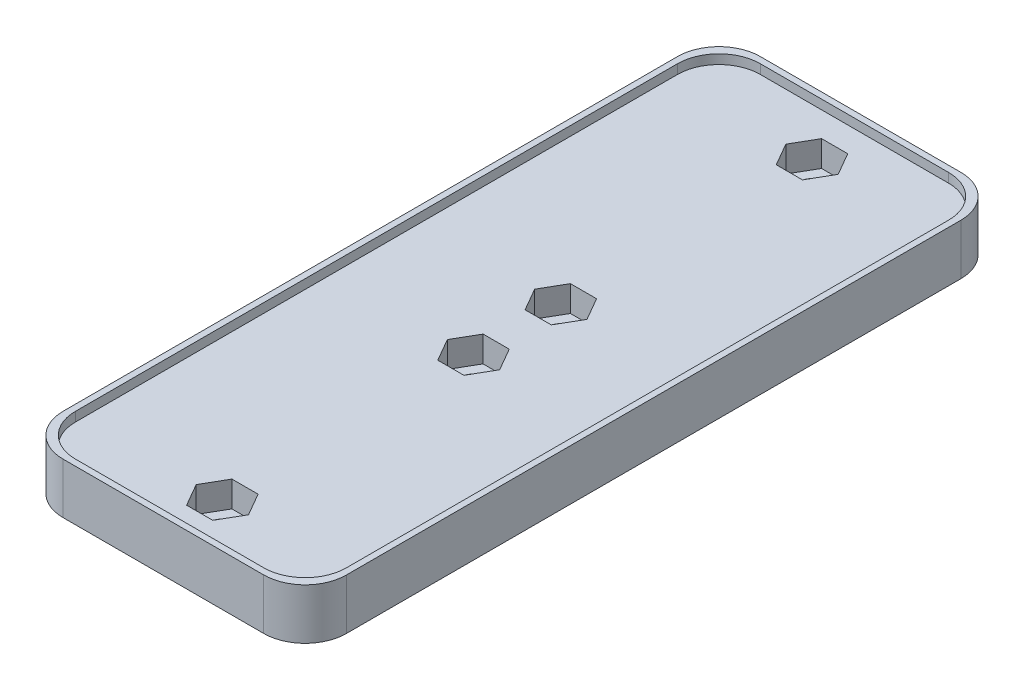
ISO-10303-21;
HEADER;
FILE_DESCRIPTION(('STEP AP214'),'2;1');
FILE_NAME('part.step','',(''),(''),'','','');
FILE_SCHEMA(('AUTOMOTIVE_DESIGN { 1 0 10303 214 1 1 1 1 }'));
ENDSEC;
DATA;
#1=APPLICATION_CONTEXT('core data for automotive mechanical design processes');
#2=APPLICATION_PROTOCOL_DEFINITION('international standard','automotive_design',2000,#1);
#3=PRODUCT_CONTEXT('',#1,'mechanical');
#4=PRODUCT('Part','Part','',(#3));
#5=PRODUCT_RELATED_PRODUCT_CATEGORY('part','',(#4));
#6=PRODUCT_DEFINITION_FORMATION('','',#4);
#7=PRODUCT_DEFINITION_CONTEXT('part definition',#1,'design');
#8=PRODUCT_DEFINITION('design','',#6,#7);
#9=PRODUCT_DEFINITION_SHAPE('','',#8);
#10=(LENGTH_UNIT() NAMED_UNIT(*) SI_UNIT(.MILLI.,.METRE.));
#11=(NAMED_UNIT(*) PLANE_ANGLE_UNIT() SI_UNIT($,.RADIAN.));
#12=(NAMED_UNIT(*) SI_UNIT($,.STERADIAN.) SOLID_ANGLE_UNIT());
#13=UNCERTAINTY_MEASURE_WITH_UNIT(LENGTH_MEASURE(1.E-05),#10,'distance_accuracy_value','');
#14=(GEOMETRIC_REPRESENTATION_CONTEXT(3) GLOBAL_UNCERTAINTY_ASSIGNED_CONTEXT((#13)) GLOBAL_UNIT_ASSIGNED_CONTEXT((#10,
#11,#12)) REPRESENTATION_CONTEXT('',''));
#15=CARTESIAN_POINT('',(0.,0.,0.));
#16=DIRECTION('',(0.,0.,1.));
#17=DIRECTION('',(1.,0.,0.));
#18=AXIS2_PLACEMENT_3D('',#15,#16,#17);
#19=CARTESIAN_POINT('',(28.829,6.223,-79.629));
#20=DIRECTION('',(0.,-1.,0.));
#21=DIRECTION('',(0.,0.,-1.));
#22=AXIS2_PLACEMENT_3D('',#19,#20,#21);
#23=CYLINDRICAL_SURFACE('',#22,5.08);
#24=DIRECTION('',(0.,-1.,0.));
#25=VECTOR('',#24,1.);
#26=CARTESIAN_POINT('',(28.829,6.223,-84.709));
#27=LINE('',#26,#25);
#28=CARTESIAN_POINT('',(28.829,6.223,-84.709));
#29=VERTEX_POINT('',#28);
#30=CARTESIAN_POINT('',(28.829,0.,-84.709));
#31=VERTEX_POINT('',#30);
#32=EDGE_CURVE('E696',#29,#31,#27,.T.);
#33=ORIENTED_EDGE('',*,*,#32,.F.);
#34=CARTESIAN_POINT('',(28.829,6.223,-79.629));
#35=DIRECTION('',(0.,-1.,0.));
#36=DIRECTION('',(0.,0.,-1.));
#37=AXIS2_PLACEMENT_3D('',#34,#35,#36);
#38=CIRCLE('',#37,5.08);
#39=CARTESIAN_POINT('',(33.909,6.223,-79.629));
#40=VERTEX_POINT('',#39);
#41=EDGE_CURVE('E51',#40,#29,#38,.F.);
#42=ORIENTED_EDGE('',*,*,#41,.F.);
#43=DIRECTION('',(0.,-1.,0.));
#44=VECTOR('',#43,1.);
#45=CARTESIAN_POINT('',(33.909,6.223,-79.629));
#46=LINE('',#45,#44);
#47=CARTESIAN_POINT('',(33.909,0.,-79.629));
#48=VERTEX_POINT('',#47);
#49=EDGE_CURVE('E700',#48,#40,#46,.F.);
#50=ORIENTED_EDGE('',*,*,#49,.F.);
#51=CARTESIAN_POINT('',(28.829,0.,-79.629));
#52=DIRECTION('',(0.,-1.,0.));
#53=DIRECTION('',(0.,0.,-1.));
#54=AXIS2_PLACEMENT_3D('',#51,#52,#53);
#55=CIRCLE('',#54,5.08);
#56=EDGE_CURVE('E11',#31,#48,#55,.T.);
#57=ORIENTED_EDGE('',*,*,#56,.F.);
#58=EDGE_LOOP('',(#33,#42,#50,#57));
#59=FACE_BOUND('',#58,.T.);
#60=ADVANCED_FACE('F43',(#59),#23,.T.);
#61=CARTESIAN_POINT('',(4.191,6.223,-4.191));
#62=DIRECTION('',(0.,-1.,0.));
#63=DIRECTION('',(0.,0.,-1.));
#64=AXIS2_PLACEMENT_3D('',#61,#62,#63);
#65=CYLINDRICAL_SURFACE('',#64,5.08);
#66=DIRECTION('',(0.,-1.,0.));
#67=VECTOR('',#66,1.);
#68=CARTESIAN_POINT('',(4.191,6.223,0.888999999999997));
#69=LINE('',#68,#67);
#70=CARTESIAN_POINT('',(4.191,6.223,0.888999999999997));
#71=VERTEX_POINT('',#70);
#72=CARTESIAN_POINT('',(4.191,0.,0.888999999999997));
#73=VERTEX_POINT('',#72);
#74=EDGE_CURVE('E682',#71,#73,#69,.T.);
#75=ORIENTED_EDGE('',*,*,#74,.F.);
#76=CARTESIAN_POINT('',(4.191,6.223,-4.191));
#77=DIRECTION('',(0.,-1.,0.));
#78=DIRECTION('',(0.,0.,-1.));
#79=AXIS2_PLACEMENT_3D('',#76,#77,#78);
#80=CIRCLE('',#79,5.08);
#81=CARTESIAN_POINT('',(-0.889,6.223,-4.191));
#82=VERTEX_POINT('',#81);
#83=EDGE_CURVE('E690',#82,#71,#80,.F.);
#84=ORIENTED_EDGE('',*,*,#83,.F.);
#85=DIRECTION('',(0.,-1.,0.));
#86=VECTOR('',#85,1.);
#87=CARTESIAN_POINT('',(-0.889,6.223,-4.191));
#88=LINE('',#87,#86);
#89=CARTESIAN_POINT('',(-0.889,0.,-4.191));
#90=VERTEX_POINT('',#89);
#91=EDGE_CURVE('E686',#90,#82,#88,.F.);
#92=ORIENTED_EDGE('',*,*,#91,.F.);
#93=CARTESIAN_POINT('',(4.191,0.,-4.191));
#94=DIRECTION('',(0.,-1.,0.));
#95=DIRECTION('',(0.,0.,-1.));
#96=AXIS2_PLACEMENT_3D('',#93,#94,#95);
#97=CIRCLE('',#96,5.08);
#98=EDGE_CURVE('E693',#73,#90,#97,.T.);
#99=ORIENTED_EDGE('',*,*,#98,.F.);
#100=EDGE_LOOP('',(#75,#84,#92,#99));
#101=FACE_BOUND('',#100,.T.);
#102=ADVANCED_FACE('F790',(#101),#65,.T.);
#103=CARTESIAN_POINT('',(28.829,6.223,-4.191));
#104=DIRECTION('',(0.,-1.,0.));
#105=DIRECTION('',(0.,0.,-1.));
#106=AXIS2_PLACEMENT_3D('',#103,#104,#105);
#107=CYLINDRICAL_SURFACE('',#106,5.08);
#108=DIRECTION('',(0.,-1.,0.));
#109=VECTOR('',#108,1.);
#110=CARTESIAN_POINT('',(33.909,6.223,-4.191));
#111=LINE('',#110,#109);
#112=CARTESIAN_POINT('',(33.909,6.223,-4.191));
#113=VERTEX_POINT('',#112);
#114=CARTESIAN_POINT('',(33.909,0.,-4.191));
#115=VERTEX_POINT('',#114);
#116=EDGE_CURVE('E667',#113,#115,#111,.T.);
#117=ORIENTED_EDGE('',*,*,#116,.F.);
#118=CARTESIAN_POINT('',(28.829,6.223,-4.191));
#119=DIRECTION('',(0.,-1.,0.));
#120=DIRECTION('',(0.,0.,-1.));
#121=AXIS2_PLACEMENT_3D('',#118,#119,#120);
#122=CIRCLE('',#121,5.08);
#123=CARTESIAN_POINT('',(28.829,6.223,0.888999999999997));
#124=VERTEX_POINT('',#123);
#125=EDGE_CURVE('E675',#124,#113,#122,.F.);
#126=ORIENTED_EDGE('',*,*,#125,.F.);
#127=DIRECTION('',(0.,-1.,0.));
#128=VECTOR('',#127,1.);
#129=CARTESIAN_POINT('',(28.829,6.223,0.888999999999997));
#130=LINE('',#129,#128);
#131=CARTESIAN_POINT('',(28.829,0.,0.888999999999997));
#132=VERTEX_POINT('',#131);
#133=EDGE_CURVE('E671',#132,#124,#130,.F.);
#134=ORIENTED_EDGE('',*,*,#133,.F.);
#135=CARTESIAN_POINT('',(28.829,0.,-4.191));
#136=DIRECTION('',(0.,-1.,0.));
#137=DIRECTION('',(0.,0.,-1.));
#138=AXIS2_PLACEMENT_3D('',#135,#136,#137);
#139=CIRCLE('',#138,5.08);
#140=EDGE_CURVE('E679',#115,#132,#139,.T.);
#141=ORIENTED_EDGE('',*,*,#140,.F.);
#142=EDGE_LOOP('',(#117,#126,#134,#141));
#143=FACE_BOUND('',#142,.T.);
#144=ADVANCED_FACE('F798',(#143),#107,.T.);
#145=CARTESIAN_POINT('',(4.953,6.223,-4.953));
#146=DIRECTION('',(0.,-1.,0.));
#147=DIRECTION('',(0.,0.,-1.));
#148=AXIS2_PLACEMENT_3D('',#145,#146,#147);
#149=CYLINDRICAL_SURFACE('',#148,5.08);
#150=DIRECTION('',(0.,1.,0.));
#151=VECTOR('',#150,1.);
#152=CARTESIAN_POINT('',(4.953,6.223,0.127));
#153=LINE('',#152,#151);
#154=CARTESIAN_POINT('',(4.953,5.08,0.127));
#155=VERTEX_POINT('',#154);
#156=CARTESIAN_POINT('',(4.953,6.223,0.127));
#157=VERTEX_POINT('',#156);
#158=EDGE_CURVE('E653',#155,#157,#153,.T.);
#159=ORIENTED_EDGE('',*,*,#158,.F.);
#160=CARTESIAN_POINT('',(4.953,5.08,-4.953));
#161=DIRECTION('',(0.,-1.,0.));
#162=DIRECTION('',(0.,0.,-1.));
#163=AXIS2_PLACEMENT_3D('',#160,#161,#162);
#164=CIRCLE('',#163,5.08);
#165=CARTESIAN_POINT('',(-0.127,5.08,-4.953));
#166=VERTEX_POINT('',#165);
#167=EDGE_CURVE('E661',#166,#155,#164,.F.);
#168=ORIENTED_EDGE('',*,*,#167,.F.);
#169=DIRECTION('',(0.,1.,0.));
#170=VECTOR('',#169,1.);
#171=CARTESIAN_POINT('',(-0.127,6.223,-4.953));
#172=LINE('',#171,#170);
#173=CARTESIAN_POINT('',(-0.127,6.223,-4.95300000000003));
#174=VERTEX_POINT('',#173);
#175=EDGE_CURVE('E657',#174,#166,#172,.F.);
#176=ORIENTED_EDGE('',*,*,#175,.F.);
#177=CARTESIAN_POINT('',(4.953,6.223,-4.953));
#178=DIRECTION('',(0.,-1.,0.));
#179=DIRECTION('',(0.,0.,-1.));
#180=AXIS2_PLACEMENT_3D('',#177,#178,#179);
#181=CIRCLE('',#180,5.08);
#182=EDGE_CURVE('E664',#174,#157,#181,.F.);
#183=ORIENTED_EDGE('',*,*,#182,.T.);
#184=EDGE_LOOP('',(#159,#168,#176,#183));
#185=FACE_BOUND('',#184,.T.);
#186=ADVANCED_FACE('F817',(#185),#149,.F.);
#187=CARTESIAN_POINT('',(28.067,6.223,-4.953));
#188=DIRECTION('',(0.,-1.,0.));
#189=DIRECTION('',(0.,0.,-1.));
#190=AXIS2_PLACEMENT_3D('',#187,#188,#189);
#191=CYLINDRICAL_SURFACE('',#190,5.08);
#192=DIRECTION('',(0.,1.,0.));
#193=VECTOR('',#192,1.);
#194=CARTESIAN_POINT('',(33.147,6.223,-4.953));
#195=LINE('',#194,#193);
#196=CARTESIAN_POINT('',(33.147,5.08,-4.953));
#197=VERTEX_POINT('',#196);
#198=CARTESIAN_POINT('',(33.147,6.223,-4.95300000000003));
#199=VERTEX_POINT('',#198);
#200=EDGE_CURVE('E639',#197,#199,#195,.T.);
#201=ORIENTED_EDGE('',*,*,#200,.F.);
#202=CARTESIAN_POINT('',(28.067,5.08,-4.953));
#203=DIRECTION('',(0.,-1.,0.));
#204=DIRECTION('',(0.,0.,-1.));
#205=AXIS2_PLACEMENT_3D('',#202,#203,#204);
#206=CIRCLE('',#205,5.08);
#207=CARTESIAN_POINT('',(28.067,5.08,0.127));
#208=VERTEX_POINT('',#207);
#209=EDGE_CURVE('E647',#208,#197,#206,.F.);
#210=ORIENTED_EDGE('',*,*,#209,.F.);
#211=DIRECTION('',(0.,1.,0.));
#212=VECTOR('',#211,1.);
#213=CARTESIAN_POINT('',(28.067,6.223,0.127));
#214=LINE('',#213,#212);
#215=CARTESIAN_POINT('',(28.067,6.223,0.127));
#216=VERTEX_POINT('',#215);
#217=EDGE_CURVE('E643',#216,#208,#214,.F.);
#218=ORIENTED_EDGE('',*,*,#217,.F.);
#219=CARTESIAN_POINT('',(28.067,6.223,-4.953));
#220=DIRECTION('',(0.,-1.,0.));
#221=DIRECTION('',(0.,0.,-1.));
#222=AXIS2_PLACEMENT_3D('',#219,#220,#221);
#223=CIRCLE('',#222,5.08);
#224=EDGE_CURVE('E650',#216,#199,#223,.F.);
#225=ORIENTED_EDGE('',*,*,#224,.T.);
#226=EDGE_LOOP('',(#201,#210,#218,#225));
#227=FACE_BOUND('',#226,.T.);
#228=ADVANCED_FACE('F822',(#227),#191,.F.);
#229=CARTESIAN_POINT('',(28.067,6.223,-78.867));
#230=DIRECTION('',(0.,-1.,0.));
#231=DIRECTION('',(0.,0.,-1.));
#232=AXIS2_PLACEMENT_3D('',#229,#230,#231);
#233=CYLINDRICAL_SURFACE('',#232,5.08);
#234=DIRECTION('',(0.,1.,0.));
#235=VECTOR('',#234,1.);
#236=CARTESIAN_POINT('',(28.067,6.223,-83.947));
#237=LINE('',#236,#235);
#238=CARTESIAN_POINT('',(28.067,5.08,-83.947));
#239=VERTEX_POINT('',#238);
#240=CARTESIAN_POINT('',(28.067,6.223,-83.947));
#241=VERTEX_POINT('',#240);
#242=EDGE_CURVE('E625',#239,#241,#237,.T.);
#243=ORIENTED_EDGE('',*,*,#242,.F.);
#244=CARTESIAN_POINT('',(28.067,5.08,-78.867));
#245=DIRECTION('',(0.,-1.,0.));
#246=DIRECTION('',(0.,0.,-1.));
#247=AXIS2_PLACEMENT_3D('',#244,#245,#246);
#248=CIRCLE('',#247,5.08);
#249=CARTESIAN_POINT('',(33.147,5.08,-78.867));
#250=VERTEX_POINT('',#249);
#251=EDGE_CURVE('E633',#250,#239,#248,.F.);
#252=ORIENTED_EDGE('',*,*,#251,.F.);
#253=DIRECTION('',(0.,1.,0.));
#254=VECTOR('',#253,1.);
#255=CARTESIAN_POINT('',(33.147,6.223,-78.867));
#256=LINE('',#255,#254);
#257=CARTESIAN_POINT('',(33.147,6.223,-78.867));
#258=VERTEX_POINT('',#257);
#259=EDGE_CURVE('E629',#258,#250,#256,.F.);
#260=ORIENTED_EDGE('',*,*,#259,.F.);
#261=CARTESIAN_POINT('',(28.067,6.223,-78.867));
#262=DIRECTION('',(0.,-1.,0.));
#263=DIRECTION('',(0.,0.,-1.));
#264=AXIS2_PLACEMENT_3D('',#261,#262,#263);
#265=CIRCLE('',#264,5.08);
#266=EDGE_CURVE('E636',#258,#241,#265,.F.);
#267=ORIENTED_EDGE('',*,*,#266,.T.);
#268=EDGE_LOOP('',(#243,#252,#260,#267));
#269=FACE_BOUND('',#268,.T.);
#270=ADVANCED_FACE('F826',(#269),#233,.F.);
#271=CARTESIAN_POINT('',(4.191,6.223,-79.629));
#272=DIRECTION('',(0.,-1.,0.));
#273=DIRECTION('',(0.,0.,-1.));
#274=AXIS2_PLACEMENT_3D('',#271,#272,#273);
#275=CYLINDRICAL_SURFACE('',#274,5.08);
#276=DIRECTION('',(0.,-1.,0.));
#277=VECTOR('',#276,1.);
#278=CARTESIAN_POINT('',(-0.889,6.223,-79.629));
#279=LINE('',#278,#277);
#280=CARTESIAN_POINT('',(-0.889,6.223,-79.629));
#281=VERTEX_POINT('',#280);
#282=CARTESIAN_POINT('',(-0.889,0.,-79.629));
#283=VERTEX_POINT('',#282);
#284=EDGE_CURVE('E610',#281,#283,#279,.T.);
#285=ORIENTED_EDGE('',*,*,#284,.F.);
#286=CARTESIAN_POINT('',(4.191,6.223,-79.629));
#287=DIRECTION('',(0.,-1.,0.));
#288=DIRECTION('',(0.,0.,-1.));
#289=AXIS2_PLACEMENT_3D('',#286,#287,#288);
#290=CIRCLE('',#289,5.08);
#291=CARTESIAN_POINT('',(4.191,6.223,-84.709));
#292=VERTEX_POINT('',#291);
#293=EDGE_CURVE('E618',#292,#281,#290,.F.);
#294=ORIENTED_EDGE('',*,*,#293,.F.);
#295=DIRECTION('',(0.,-1.,0.));
#296=VECTOR('',#295,1.);
#297=CARTESIAN_POINT('',(4.191,6.223,-84.709));
#298=LINE('',#297,#296);
#299=CARTESIAN_POINT('',(4.191,0.,-84.709));
#300=VERTEX_POINT('',#299);
#301=EDGE_CURVE('E614',#300,#292,#298,.F.);
#302=ORIENTED_EDGE('',*,*,#301,.F.);
#303=CARTESIAN_POINT('',(4.191,0.,-79.629));
#304=DIRECTION('',(0.,-1.,0.));
#305=DIRECTION('',(0.,0.,-1.));
#306=AXIS2_PLACEMENT_3D('',#303,#304,#305);
#307=CIRCLE('',#306,5.08);
#308=EDGE_CURVE('E622',#283,#300,#307,.T.);
#309=ORIENTED_EDGE('',*,*,#308,.F.);
#310=EDGE_LOOP('',(#285,#294,#302,#309));
#311=FACE_BOUND('',#310,.T.);
#312=ADVANCED_FACE('F782',(#311),#275,.T.);
#313=CARTESIAN_POINT('',(4.953,6.223,-78.867));
#314=DIRECTION('',(0.,1.,0.));
#315=DIRECTION('',(0.,0.,1.));
#316=AXIS2_PLACEMENT_3D('',#313,#314,#315);
#317=CYLINDRICAL_SURFACE('',#316,5.08);
#318=DIRECTION('',(0.,-1.,0.));
#319=VECTOR('',#318,1.);
#320=CARTESIAN_POINT('',(4.953,6.223,-83.947));
#321=LINE('',#320,#319);
#322=CARTESIAN_POINT('',(4.953,6.223,-83.947));
#323=VERTEX_POINT('',#322);
#324=CARTESIAN_POINT('',(4.953,5.08,-83.947));
#325=VERTEX_POINT('',#324);
#326=EDGE_CURVE('E366',#323,#325,#321,.T.);
#327=ORIENTED_EDGE('',*,*,#326,.F.);
#328=CARTESIAN_POINT('',(4.953,6.223,-78.867));
#329=DIRECTION('',(0.,-1.,0.));
#330=DIRECTION('',(0.,0.,-1.));
#331=AXIS2_PLACEMENT_3D('',#328,#329,#330);
#332=CIRCLE('',#331,5.08);
#333=CARTESIAN_POINT('',(-0.127,6.223,-78.867));
#334=VERTEX_POINT('',#333);
#335=EDGE_CURVE('E606',#323,#334,#332,.F.);
#336=ORIENTED_EDGE('',*,*,#335,.T.);
#337=DIRECTION('',(0.,-1.,0.));
#338=VECTOR('',#337,1.);
#339=CARTESIAN_POINT('',(-0.127,6.223,-78.867));
#340=LINE('',#339,#338);
#341=CARTESIAN_POINT('',(-0.127,5.08,-78.867));
#342=VERTEX_POINT('',#341);
#343=EDGE_CURVE('E598',#342,#334,#340,.F.);
#344=ORIENTED_EDGE('',*,*,#343,.F.);
#345=CARTESIAN_POINT('',(4.953,5.08,-78.867));
#346=DIRECTION('',(0.,-1.,0.));
#347=DIRECTION('',(0.,0.,-1.));
#348=AXIS2_PLACEMENT_3D('',#345,#346,#347);
#349=CIRCLE('',#348,5.08);
#350=EDGE_CURVE('E602',#325,#342,#349,.F.);
#351=ORIENTED_EDGE('',*,*,#350,.F.);
#352=EDGE_LOOP('',(#327,#336,#344,#351));
#353=FACE_BOUND('',#352,.T.);
#354=ADVANCED_FACE('F833',(#353),#317,.F.);
#355=CARTESIAN_POINT('',(0.,5.08,0.));
#356=DIRECTION('',(0.,-1.,0.));
#357=DIRECTION('',(0.,0.,-1.));
#358=AXIS2_PLACEMENT_3D('',#355,#356,#357);
#359=PLANE('',#358);
#360=DIRECTION('',(-0.5,0.,-0.866025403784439));
#361=VECTOR('',#360,1.);
#362=CARTESIAN_POINT('',(20.3565686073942,5.08,-5.71500000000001));
#363=LINE('',#362,#361);
#364=CARTESIAN_POINT('',(20.3565686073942,5.08,-5.71500000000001));
#365=VERTEX_POINT('',#364);
#366=CARTESIAN_POINT('',(18.7507843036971,5.08,-8.4963));
#367=VERTEX_POINT('',#366);
#368=EDGE_CURVE('E348',#365,#367,#363,.T.);
#369=ORIENTED_EDGE('',*,*,#368,.F.);
#370=DIRECTION('',(0.499999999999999,0.,-0.866025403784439));
#371=VECTOR('',#370,1.);
#372=CARTESIAN_POINT('',(18.7507843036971,5.08,-2.93370000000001));
#373=LINE('',#372,#371);
#374=CARTESIAN_POINT('',(18.7507843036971,5.08,-2.93370000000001));
#375=VERTEX_POINT('',#374);
#376=EDGE_CURVE('E304',#375,#365,#373,.T.);
#377=ORIENTED_EDGE('',*,*,#376,.F.);
#378=DIRECTION('',(1.,0.,0.));
#379=VECTOR('',#378,1.);
#380=CARTESIAN_POINT('',(15.5392156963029,5.08,-2.93370000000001));
#381=LINE('',#380,#379);
#382=CARTESIAN_POINT('',(15.5392156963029,5.08,-2.93370000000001));
#383=VERTEX_POINT('',#382);
#384=EDGE_CURVE('E325',#383,#375,#381,.T.);
#385=ORIENTED_EDGE('',*,*,#384,.F.);
#386=DIRECTION('',(0.5,0.,0.866025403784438));
#387=VECTOR('',#386,1.);
#388=CARTESIAN_POINT('',(13.9334313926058,5.08,-5.71500000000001));
#389=LINE('',#388,#387);
#390=CARTESIAN_POINT('',(13.9334313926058,5.08,-5.71500000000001));
#391=VERTEX_POINT('',#390);
#392=EDGE_CURVE('E329',#391,#383,#389,.T.);
#393=ORIENTED_EDGE('',*,*,#392,.F.);
#394=DIRECTION('',(-0.5,0.,0.866025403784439));
#395=VECTOR('',#394,1.);
#396=CARTESIAN_POINT('',(15.5392156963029,5.08,-8.4963));
#397=LINE('',#396,#395);
#398=CARTESIAN_POINT('',(15.5392156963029,5.08,-8.4963));
#399=VERTEX_POINT('',#398);
#400=EDGE_CURVE('E356',#399,#391,#397,.T.);
#401=ORIENTED_EDGE('',*,*,#400,.F.);
#402=DIRECTION('',(-1.,0.,0.));
#403=VECTOR('',#402,1.);
#404=CARTESIAN_POINT('',(18.7507843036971,5.08,-8.4963));
#405=LINE('',#404,#403);
#406=EDGE_CURVE('E352',#367,#399,#405,.T.);
#407=ORIENTED_EDGE('',*,*,#406,.F.);
#408=EDGE_LOOP('',(#369,#377,#385,#393,#401,#407));
#409=FACE_BOUND('',#408,.T.);
#410=DIRECTION('',(-0.500000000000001,0.,-0.866025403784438));
#411=VECTOR('',#410,1.);
#412=CARTESIAN_POINT('',(20.3565686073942,5.08,-47.2694));
#413=LINE('',#412,#411);
#414=CARTESIAN_POINT('',(20.3565686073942,5.08,-47.2694));
#415=VERTEX_POINT('',#414);
#416=CARTESIAN_POINT('',(18.7507843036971,5.08,-50.0507));
#417=VERTEX_POINT('',#416);
#418=EDGE_CURVE('E415',#415,#417,#413,.T.);
#419=ORIENTED_EDGE('',*,*,#418,.F.);
#420=DIRECTION('',(0.5,0.,-0.866025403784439));
#421=VECTOR('',#420,1.);
#422=CARTESIAN_POINT('',(18.7507843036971,5.08,-44.4881));
#423=LINE('',#422,#421);
#424=CARTESIAN_POINT('',(18.7507843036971,5.08,-44.4881));
#425=VERTEX_POINT('',#424);
#426=EDGE_CURVE('E419',#425,#415,#423,.T.);
#427=ORIENTED_EDGE('',*,*,#426,.F.);
#428=DIRECTION('',(1.,0.,0.));
#429=VECTOR('',#428,1.);
#430=CARTESIAN_POINT('',(15.5392156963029,5.08,-44.4881));
#431=LINE('',#430,#429);
#432=CARTESIAN_POINT('',(15.5392156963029,5.08,-44.4881));
#433=VERTEX_POINT('',#432);
#434=EDGE_CURVE('E398',#433,#425,#431,.T.);
#435=ORIENTED_EDGE('',*,*,#434,.F.);
#436=DIRECTION('',(0.5,0.,0.866025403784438));
#437=VECTOR('',#436,1.);
#438=CARTESIAN_POINT('',(13.9334313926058,5.08,-47.2694));
#439=LINE('',#438,#437);
#440=CARTESIAN_POINT('',(13.9334313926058,5.08,-47.2694));
#441=VERTEX_POINT('',#440);
#442=EDGE_CURVE('E402',#441,#433,#439,.T.);
#443=ORIENTED_EDGE('',*,*,#442,.F.);
#444=DIRECTION('',(-0.500000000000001,0.,0.866025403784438));
#445=VECTOR('',#444,1.);
#446=CARTESIAN_POINT('',(15.5392156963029,5.08,-50.0507));
#447=LINE('',#446,#445);
#448=CARTESIAN_POINT('',(15.5392156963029,5.08,-50.0507));
#449=VERTEX_POINT('',#448);
#450=EDGE_CURVE('E407',#449,#441,#447,.T.);
#451=ORIENTED_EDGE('',*,*,#450,.F.);
#452=DIRECTION('',(-1.,0.,0.));
#453=VECTOR('',#452,1.);
#454=CARTESIAN_POINT('',(18.7507843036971,5.08,-50.0507));
#455=LINE('',#454,#453);
#456=EDGE_CURVE('E411',#417,#449,#455,.T.);
#457=ORIENTED_EDGE('',*,*,#456,.F.);
#458=EDGE_LOOP('',(#419,#427,#435,#443,#451,#457));
#459=FACE_BOUND('',#458,.T.);
#460=DIRECTION('',(-0.5,0.,-0.866025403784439));
#461=VECTOR('',#460,1.);
#462=CARTESIAN_POINT('',(20.3565686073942,5.08,-36.5506));
#463=LINE('',#462,#461);
#464=CARTESIAN_POINT('',(20.3565686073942,5.08,-36.5506));
#465=VERTEX_POINT('',#464);
#466=CARTESIAN_POINT('',(18.7507843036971,5.08,-39.3319));
#467=VERTEX_POINT('',#466);
#468=EDGE_CURVE('E547',#465,#467,#463,.T.);
#469=ORIENTED_EDGE('',*,*,#468,.F.);
#470=DIRECTION('',(0.499999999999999,0.,-0.866025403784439));
#471=VECTOR('',#470,1.);
#472=CARTESIAN_POINT('',(18.7507843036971,5.08,-33.7693));
#473=LINE('',#472,#471);
#474=CARTESIAN_POINT('',(18.7507843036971,5.08,-33.7693));
#475=VERTEX_POINT('',#474);
#476=EDGE_CURVE('E465',#475,#465,#473,.T.);
#477=ORIENTED_EDGE('',*,*,#476,.F.);
#478=DIRECTION('',(1.,0.,0.));
#479=VECTOR('',#478,1.);
#480=CARTESIAN_POINT('',(15.5392156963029,5.08,-33.7693));
#481=LINE('',#480,#479);
#482=CARTESIAN_POINT('',(15.5392156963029,5.08,-33.7693));
#483=VERTEX_POINT('',#482);
#484=EDGE_CURVE('E530',#483,#475,#481,.T.);
#485=ORIENTED_EDGE('',*,*,#484,.F.);
#486=DIRECTION('',(0.5,0.,0.866025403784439));
#487=VECTOR('',#486,1.);
#488=CARTESIAN_POINT('',(13.9334313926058,5.08,-36.5506));
#489=LINE('',#488,#487);
#490=CARTESIAN_POINT('',(13.9334313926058,5.08,-36.5506));
#491=VERTEX_POINT('',#490);
#492=EDGE_CURVE('E534',#491,#483,#489,.T.);
#493=ORIENTED_EDGE('',*,*,#492,.F.);
#494=DIRECTION('',(-0.499999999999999,0.,0.866025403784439));
#495=VECTOR('',#494,1.);
#496=CARTESIAN_POINT('',(15.5392156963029,5.08,-39.3319));
#497=LINE('',#496,#495);
#498=CARTESIAN_POINT('',(15.5392156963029,5.08,-39.3319));
#499=VERTEX_POINT('',#498);
#500=EDGE_CURVE('E539',#499,#491,#497,.T.);
#501=ORIENTED_EDGE('',*,*,#500,.F.);
#502=DIRECTION('',(-1.,0.,0.));
#503=VECTOR('',#502,1.);
#504=CARTESIAN_POINT('',(18.7507843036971,5.08,-39.3319));
#505=LINE('',#504,#503);
#506=EDGE_CURVE('E543',#467,#499,#505,.T.);
#507=ORIENTED_EDGE('',*,*,#506,.F.);
#508=EDGE_LOOP('',(#469,#477,#485,#493,#501,#507));
#509=FACE_BOUND('',#508,.T.);
#510=DIRECTION('',(-0.500000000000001,0.,-0.866025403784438));
#511=VECTOR('',#510,1.);
#512=CARTESIAN_POINT('',(20.3565686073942,5.08,-78.105));
#513=LINE('',#512,#511);
#514=CARTESIAN_POINT('',(20.3565686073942,5.08,-78.105));
#515=VERTEX_POINT('',#514);
#516=CARTESIAN_POINT('',(18.7507843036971,5.08,-80.8863));
#517=VERTEX_POINT('',#516);
#518=EDGE_CURVE('E483',#515,#517,#513,.T.);
#519=ORIENTED_EDGE('',*,*,#518,.F.);
#520=DIRECTION('',(0.499999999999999,0.,-0.866025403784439));
#521=VECTOR('',#520,1.);
#522=CARTESIAN_POINT('',(18.7507843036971,5.08,-75.3237));
#523=LINE('',#522,#521);
#524=CARTESIAN_POINT('',(18.7507843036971,5.08,-75.3237));
#525=VERTEX_POINT('',#524);
#526=EDGE_CURVE('E349',#525,#515,#523,.T.);
#527=ORIENTED_EDGE('',*,*,#526,.F.);
#528=DIRECTION('',(1.,0.,0.));
#529=VECTOR('',#528,1.);
#530=CARTESIAN_POINT('',(15.5392156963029,5.08,-75.3237));
#531=LINE('',#530,#529);
#532=CARTESIAN_POINT('',(15.5392156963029,5.08,-75.3237));
#533=VERTEX_POINT('',#532);
#534=EDGE_CURVE('E466',#533,#525,#531,.T.);
#535=ORIENTED_EDGE('',*,*,#534,.F.);
#536=DIRECTION('',(0.499999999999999,0.,0.866025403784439));
#537=VECTOR('',#536,1.);
#538=CARTESIAN_POINT('',(13.9334313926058,5.08,-78.105));
#539=LINE('',#538,#537);
#540=CARTESIAN_POINT('',(13.9334313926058,5.08,-78.105));
#541=VERTEX_POINT('',#540);
#542=EDGE_CURVE('E470',#541,#533,#539,.T.);
#543=ORIENTED_EDGE('',*,*,#542,.F.);
#544=DIRECTION('',(-0.5,0.,0.866025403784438));
#545=VECTOR('',#544,1.);
#546=CARTESIAN_POINT('',(15.5392156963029,5.08,-80.8863));
#547=LINE('',#546,#545);
#548=CARTESIAN_POINT('',(15.5392156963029,5.08,-80.8863));
#549=VERTEX_POINT('',#548);
#550=EDGE_CURVE('E475',#549,#541,#547,.T.);
#551=ORIENTED_EDGE('',*,*,#550,.F.);
#552=DIRECTION('',(-1.,0.,0.));
#553=VECTOR('',#552,1.);
#554=CARTESIAN_POINT('',(18.7507843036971,5.08,-80.8863));
#555=LINE('',#554,#553);
#556=EDGE_CURVE('E479',#517,#549,#555,.T.);
#557=ORIENTED_EDGE('',*,*,#556,.F.);
#558=EDGE_LOOP('',(#519,#527,#535,#543,#551,#557));
#559=FACE_BOUND('',#558,.T.);
#560=DIRECTION('',(0.,0.,-1.));
#561=VECTOR('',#560,1.);
#562=CARTESIAN_POINT('',(-0.127,5.08,0.127));
#563=LINE('',#562,#561);
#564=EDGE_CURVE('E728',#166,#342,#563,.T.);
#565=ORIENTED_EDGE('',*,*,#564,.F.);
#566=ORIENTED_EDGE('',*,*,#167,.T.);
#567=DIRECTION('',(-1.,0.,0.));
#568=VECTOR('',#567,1.);
#569=CARTESIAN_POINT('',(-0.127,5.08,0.127));
#570=LINE('',#569,#568);
#571=EDGE_CURVE('E580',#208,#155,#570,.T.);
#572=ORIENTED_EDGE('',*,*,#571,.F.);
#573=ORIENTED_EDGE('',*,*,#209,.T.);
#574=DIRECTION('',(0.,0.,1.));
#575=VECTOR('',#574,1.);
#576=CARTESIAN_POINT('',(33.147,5.08,0.127));
#577=LINE('',#576,#575);
#578=EDGE_CURVE('E748',#250,#197,#577,.T.);
#579=ORIENTED_EDGE('',*,*,#578,.F.);
#580=ORIENTED_EDGE('',*,*,#251,.T.);
#581=DIRECTION('',(1.,0.,0.));
#582=VECTOR('',#581,1.);
#583=CARTESIAN_POINT('',(-0.127,5.08,-83.947));
#584=LINE('',#583,#582);
#585=EDGE_CURVE('E744',#325,#239,#584,.T.);
#586=ORIENTED_EDGE('',*,*,#585,.F.);
#587=ORIENTED_EDGE('',*,*,#350,.T.);
#588=EDGE_LOOP('',(#565,#566,#572,#573,#579,#580,#586,#587));
#589=FACE_BOUND('',#588,.T.);
#590=ADVANCED_FACE('F771',(#409,#459,#509,#559,#589),#359,.F.);
#591=CARTESIAN_POINT('',(0.,0.,0.));
#592=DIRECTION('',(0.,-1.,0.));
#593=DIRECTION('',(0.,0.,-1.));
#594=AXIS2_PLACEMENT_3D('',#591,#592,#593);
#595=PLANE('',#594);
#596=CARTESIAN_POINT('',(17.145,0.,-5.71500000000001));
#597=DIRECTION('',(0.,-1.,0.));
#598=DIRECTION('',(0.,0.,-1.));
#599=AXIS2_PLACEMENT_3D('',#596,#597,#598);
#600=CIRCLE('',#599,1.5875);
#601=CARTESIAN_POINT('',(17.145,0.,-4.12750000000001));
#602=VERTEX_POINT('',#601);
#603=EDGE_CURVE('E579',#602,#602,#600,.T.);
#604=ORIENTED_EDGE('',*,*,#603,.F.);
#605=EDGE_LOOP('',(#604));
#606=FACE_BOUND('',#605,.T.);
#607=CARTESIAN_POINT('',(17.145,0.,-36.5506));
#608=DIRECTION('',(0.,-1.,0.));
#609=DIRECTION('',(0.,0.,-1.));
#610=AXIS2_PLACEMENT_3D('',#607,#608,#609);
#611=CIRCLE('',#610,1.5875);
#612=CARTESIAN_POINT('',(17.145,0.,-34.9631));
#613=VERTEX_POINT('',#612);
#614=EDGE_CURVE('E590',#613,#613,#611,.T.);
#615=ORIENTED_EDGE('',*,*,#614,.F.);
#616=EDGE_LOOP('',(#615));
#617=FACE_BOUND('',#616,.T.);
#618=CARTESIAN_POINT('',(17.145,0.,-47.2694));
#619=DIRECTION('',(0.,-1.,0.));
#620=DIRECTION('',(0.,0.,-1.));
#621=AXIS2_PLACEMENT_3D('',#618,#619,#620);
#622=CIRCLE('',#621,1.5875);
#623=CARTESIAN_POINT('',(17.145,0.,-45.6819));
#624=VERTEX_POINT('',#623);
#625=EDGE_CURVE('E585',#624,#624,#622,.T.);
#626=ORIENTED_EDGE('',*,*,#625,.F.);
#627=EDGE_LOOP('',(#626));
#628=FACE_BOUND('',#627,.T.);
#629=CARTESIAN_POINT('',(17.145,0.,-78.105));
#630=DIRECTION('',(0.,-1.,0.));
#631=DIRECTION('',(0.,0.,-1.));
#632=AXIS2_PLACEMENT_3D('',#629,#630,#631);
#633=CIRCLE('',#632,1.5875);
#634=CARTESIAN_POINT('',(17.145,0.,-76.5175));
#635=VERTEX_POINT('',#634);
#636=EDGE_CURVE('E332',#635,#635,#633,.T.);
#637=ORIENTED_EDGE('',*,*,#636,.F.);
#638=EDGE_LOOP('',(#637));
#639=FACE_BOUND('',#638,.T.);
#640=DIRECTION('',(1.,0.,0.));
#641=VECTOR('',#640,1.);
#642=CARTESIAN_POINT('',(-0.889,0.,-84.709));
#643=LINE('',#642,#641);
#644=EDGE_CURVE('E732',#300,#31,#643,.T.);
#645=ORIENTED_EDGE('',*,*,#644,.T.);
#646=ORIENTED_EDGE('',*,*,#56,.T.);
#647=DIRECTION('',(0.,0.,1.));
#648=VECTOR('',#647,1.);
#649=CARTESIAN_POINT('',(33.909,0.,0.888999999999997));
#650=LINE('',#649,#648);
#651=EDGE_CURVE('E736',#48,#115,#650,.T.);
#652=ORIENTED_EDGE('',*,*,#651,.T.);
#653=ORIENTED_EDGE('',*,*,#140,.T.);
#654=DIRECTION('',(-1.,0.,0.));
#655=VECTOR('',#654,1.);
#656=CARTESIAN_POINT('',(-0.889,0.,0.888999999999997));
#657=LINE('',#656,#655);
#658=EDGE_CURVE('E721',#132,#73,#657,.T.);
#659=ORIENTED_EDGE('',*,*,#658,.T.);
#660=ORIENTED_EDGE('',*,*,#98,.T.);
#661=DIRECTION('',(0.,0.,-1.));
#662=VECTOR('',#661,1.);
#663=CARTESIAN_POINT('',(-0.889,0.,0.888999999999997));
#664=LINE('',#663,#662);
#665=EDGE_CURVE('E729',#90,#283,#664,.T.);
#666=ORIENTED_EDGE('',*,*,#665,.T.);
#667=ORIENTED_EDGE('',*,*,#308,.T.);
#668=EDGE_LOOP('',(#645,#646,#652,#653,#659,#660,#666,#667));
#669=FACE_BOUND('',#668,.T.);
#670=ADVANCED_FACE('F767',(#606,#617,#628,#639,#669),#595,.T.);
#671=CARTESIAN_POINT('',(18.7507843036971,1.905,-75.3237));
#672=DIRECTION('',(0.866025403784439,0.,0.499999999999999));
#673=DIRECTION('',(0.499999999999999,0.,-0.866025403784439));
#674=AXIS2_PLACEMENT_3D('',#671,#672,#673);
#675=PLANE('',#674);
#676=ORIENTED_EDGE('',*,*,#526,.T.);
#677=DIRECTION('',(0.,1.,0.));
#678=VECTOR('',#677,1.);
#679=CARTESIAN_POINT('',(20.3565686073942,1.905,-78.105));
#680=LINE('',#679,#678);
#681=CARTESIAN_POINT('',(20.3565686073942,1.905,-78.105));
#682=VERTEX_POINT('',#681);
#683=EDGE_CURVE('E445',#682,#515,#680,.T.);
#684=ORIENTED_EDGE('',*,*,#683,.F.);
#685=DIRECTION('',(0.499999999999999,0.,-0.866025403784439));
#686=VECTOR('',#685,1.);
#687=CARTESIAN_POINT('',(18.7507843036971,1.905,-75.3237));
#688=LINE('',#687,#686);
#689=CARTESIAN_POINT('',(18.7507843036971,1.905,-75.3237));
#690=VERTEX_POINT('',#689);
#691=EDGE_CURVE('E471',#690,#682,#688,.T.);
#692=ORIENTED_EDGE('',*,*,#691,.F.);
#693=DIRECTION('',(0.,1.,0.));
#694=VECTOR('',#693,1.);
#695=CARTESIAN_POINT('',(18.7507843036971,1.905,-75.3237));
#696=LINE('',#695,#694);
#697=EDGE_CURVE('E462',#690,#525,#696,.T.);
#698=ORIENTED_EDGE('',*,*,#697,.T.);
#699=EDGE_LOOP('',(#676,#684,#692,#698));
#700=FACE_BOUND('',#699,.T.);
#701=ADVANCED_FACE('F770',(#700),#675,.F.);
#702=CARTESIAN_POINT('',(15.5392156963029,1.905,-75.3237));
#703=DIRECTION('',(0.,0.,1.));
#704=DIRECTION('',(1.,0.,0.));
#705=AXIS2_PLACEMENT_3D('',#702,#703,#704);
#706=PLANE('',#705);
#707=ORIENTED_EDGE('',*,*,#534,.T.);
#708=ORIENTED_EDGE('',*,*,#697,.F.);
#709=DIRECTION('',(1.,0.,0.));
#710=VECTOR('',#709,1.);
#711=CARTESIAN_POINT('',(15.5392156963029,1.905,-75.3237));
#712=LINE('',#711,#710);
#713=CARTESIAN_POINT('',(15.5392156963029,1.905,-75.3237));
#714=VERTEX_POINT('',#713);
#715=EDGE_CURVE('E449',#714,#690,#712,.T.);
#716=ORIENTED_EDGE('',*,*,#715,.F.);
#717=DIRECTION('',(0.,1.,0.));
#718=VECTOR('',#717,1.);
#719=CARTESIAN_POINT('',(15.5392156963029,1.905,-75.3237));
#720=LINE('',#719,#718);
#721=EDGE_CURVE('E459',#714,#533,#720,.T.);
#722=ORIENTED_EDGE('',*,*,#721,.T.);
#723=EDGE_LOOP('',(#707,#708,#716,#722));
#724=FACE_BOUND('',#723,.T.);
#725=ADVANCED_FACE('F874',(#724),#706,.F.);
#726=CARTESIAN_POINT('',(13.9334313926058,1.905,-78.105));
#727=DIRECTION('',(-0.866025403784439,0.,0.499999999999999));
#728=DIRECTION('',(0.5,0.,0.866025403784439));
#729=AXIS2_PLACEMENT_3D('',#726,#727,#728);
#730=PLANE('',#729);
#731=ORIENTED_EDGE('',*,*,#542,.T.);
#732=ORIENTED_EDGE('',*,*,#721,.F.);
#733=DIRECTION('',(0.499999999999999,0.,0.866025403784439));
#734=VECTOR('',#733,1.);
#735=CARTESIAN_POINT('',(13.9334313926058,1.905,-78.105));
#736=LINE('',#735,#734);
#737=CARTESIAN_POINT('',(13.9334313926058,1.905,-78.105));
#738=VERTEX_POINT('',#737);
#739=EDGE_CURVE('E492',#738,#714,#736,.T.);
#740=ORIENTED_EDGE('',*,*,#739,.F.);
#741=DIRECTION('',(0.,1.,0.));
#742=VECTOR('',#741,1.);
#743=CARTESIAN_POINT('',(13.9334313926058,1.905,-78.105));
#744=LINE('',#743,#742);
#745=EDGE_CURVE('E456',#738,#541,#744,.T.);
#746=ORIENTED_EDGE('',*,*,#745,.T.);
#747=EDGE_LOOP('',(#731,#732,#740,#746));
#748=FACE_BOUND('',#747,.T.);
#749=ADVANCED_FACE('F877',(#748),#730,.F.);
#750=CARTESIAN_POINT('',(15.5392156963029,1.905,-80.8863));
#751=DIRECTION('',(-0.866025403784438,0.,-0.5));
#752=DIRECTION('',(-0.500000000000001,0.,0.866025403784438));
#753=AXIS2_PLACEMENT_3D('',#750,#751,#752);
#754=PLANE('',#753);
#755=ORIENTED_EDGE('',*,*,#550,.T.);
#756=ORIENTED_EDGE('',*,*,#745,.F.);
#757=DIRECTION('',(-0.5,0.,0.866025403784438));
#758=VECTOR('',#757,1.);
#759=CARTESIAN_POINT('',(15.5392156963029,1.905,-80.8863));
#760=LINE('',#759,#758);
#761=CARTESIAN_POINT('',(15.5392156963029,1.905,-80.8863));
#762=VERTEX_POINT('',#761);
#763=EDGE_CURVE('E496',#762,#738,#760,.T.);
#764=ORIENTED_EDGE('',*,*,#763,.F.);
#765=DIRECTION('',(0.,1.,0.));
#766=VECTOR('',#765,1.);
#767=CARTESIAN_POINT('',(15.5392156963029,1.905,-80.8863));
#768=LINE('',#767,#766);
#769=EDGE_CURVE('E453',#762,#549,#768,.T.);
#770=ORIENTED_EDGE('',*,*,#769,.T.);
#771=EDGE_LOOP('',(#755,#756,#764,#770));
#772=FACE_BOUND('',#771,.T.);
#773=ADVANCED_FACE('F881',(#772),#754,.F.);
#774=CARTESIAN_POINT('',(18.7507843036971,1.905,-80.8863));
#775=DIRECTION('',(0.,0.,-1.));
#776=DIRECTION('',(-1.,0.,0.));
#777=AXIS2_PLACEMENT_3D('',#774,#775,#776);
#778=PLANE('',#777);
#779=ORIENTED_EDGE('',*,*,#556,.T.);
#780=ORIENTED_EDGE('',*,*,#769,.F.);
#781=DIRECTION('',(-1.,0.,0.));
#782=VECTOR('',#781,1.);
#783=CARTESIAN_POINT('',(18.7507843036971,1.905,-80.8863));
#784=LINE('',#783,#782);
#785=CARTESIAN_POINT('',(18.7507843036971,1.905,-80.8863));
#786=VERTEX_POINT('',#785);
#787=EDGE_CURVE('E500',#786,#762,#784,.T.);
#788=ORIENTED_EDGE('',*,*,#787,.F.);
#789=DIRECTION('',(0.,1.,0.));
#790=VECTOR('',#789,1.);
#791=CARTESIAN_POINT('',(18.7507843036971,1.905,-80.8863));
#792=LINE('',#791,#790);
#793=EDGE_CURVE('E450',#786,#517,#792,.T.);
#794=ORIENTED_EDGE('',*,*,#793,.T.);
#795=EDGE_LOOP('',(#779,#780,#788,#794));
#796=FACE_BOUND('',#795,.T.);
#797=ADVANCED_FACE('F885',(#796),#778,.F.);
#798=CARTESIAN_POINT('',(20.3565686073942,1.905,-78.105));
#799=DIRECTION('',(0.866025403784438,0.,-0.500000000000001));
#800=DIRECTION('',(-0.500000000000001,0.,-0.866025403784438));
#801=AXIS2_PLACEMENT_3D('',#798,#799,#800);
#802=PLANE('',#801);
#803=ORIENTED_EDGE('',*,*,#518,.T.);
#804=ORIENTED_EDGE('',*,*,#793,.F.);
#805=DIRECTION('',(-0.500000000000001,0.,-0.866025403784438));
#806=VECTOR('',#805,1.);
#807=CARTESIAN_POINT('',(20.3565686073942,1.905,-78.105));
#808=LINE('',#807,#806);
#809=EDGE_CURVE('E504',#682,#786,#808,.T.);
#810=ORIENTED_EDGE('',*,*,#809,.F.);
#811=ORIENTED_EDGE('',*,*,#683,.T.);
#812=EDGE_LOOP('',(#803,#804,#810,#811));
#813=FACE_BOUND('',#812,.T.);
#814=ADVANCED_FACE('F872',(#813),#802,.F.);
#815=CARTESIAN_POINT('',(0.,1.905,0.));
#816=DIRECTION('',(0.,1.,0.));
#817=DIRECTION('',(0.,0.,1.));
#818=AXIS2_PLACEMENT_3D('',#815,#816,#817);
#819=PLANE('',#818);
#820=CARTESIAN_POINT('',(17.145,1.905,-78.105));
#821=DIRECTION('',(0.,1.,0.));
#822=DIRECTION('',(0.,0.,1.));
#823=AXIS2_PLACEMENT_3D('',#820,#821,#822);
#824=CIRCLE('',#823,1.5875);
#825=CARTESIAN_POINT('',(17.145,1.905,-76.5175));
#826=VERTEX_POINT('',#825);
#827=EDGE_CURVE('E591',#826,#826,#824,.T.);
#828=ORIENTED_EDGE('',*,*,#827,.F.);
#829=EDGE_LOOP('',(#828));
#830=FACE_BOUND('',#829,.T.);
#831=ORIENTED_EDGE('',*,*,#691,.T.);
#832=ORIENTED_EDGE('',*,*,#809,.T.);
#833=ORIENTED_EDGE('',*,*,#787,.T.);
#834=ORIENTED_EDGE('',*,*,#763,.T.);
#835=ORIENTED_EDGE('',*,*,#739,.T.);
#836=ORIENTED_EDGE('',*,*,#715,.T.);
#837=EDGE_LOOP('',(#831,#832,#833,#834,#835,#836));
#838=FACE_BOUND('',#837,.T.);
#839=ADVANCED_FACE('F868',(#830,#838),#819,.T.);
#840=CARTESIAN_POINT('',(18.7507843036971,1.905,-33.7693));
#841=DIRECTION('',(0.866025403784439,0.,0.499999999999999));
#842=DIRECTION('',(0.499999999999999,0.,-0.866025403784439));
#843=AXIS2_PLACEMENT_3D('',#840,#841,#842);
#844=PLANE('',#843);
#845=ORIENTED_EDGE('',*,*,#476,.T.);
#846=DIRECTION('',(0.,1.,0.));
#847=VECTOR('',#846,1.);
#848=CARTESIAN_POINT('',(20.3565686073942,1.905,-36.5506));
#849=LINE('',#848,#847);
#850=CARTESIAN_POINT('',(20.3565686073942,1.905,-36.5506));
#851=VERTEX_POINT('',#850);
#852=EDGE_CURVE('E511',#851,#465,#849,.T.);
#853=ORIENTED_EDGE('',*,*,#852,.F.);
#854=DIRECTION('',(0.499999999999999,0.,-0.866025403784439));
#855=VECTOR('',#854,1.);
#856=CARTESIAN_POINT('',(18.7507843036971,1.905,-33.7693));
#857=LINE('',#856,#855);
#858=CARTESIAN_POINT('',(18.7507843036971,1.905,-33.7693));
#859=VERTEX_POINT('',#858);
#860=EDGE_CURVE('E535',#859,#851,#857,.T.);
#861=ORIENTED_EDGE('',*,*,#860,.F.);
#862=DIRECTION('',(0.,1.,0.));
#863=VECTOR('',#862,1.);
#864=CARTESIAN_POINT('',(18.7507843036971,1.905,-33.7693));
#865=LINE('',#864,#863);
#866=EDGE_CURVE('E422',#859,#475,#865,.T.);
#867=ORIENTED_EDGE('',*,*,#866,.T.);
#868=EDGE_LOOP('',(#845,#853,#861,#867));
#869=FACE_BOUND('',#868,.T.);
#870=ADVANCED_FACE('F850',(#869),#844,.F.);
#871=CARTESIAN_POINT('',(15.5392156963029,1.905,-33.7693));
#872=DIRECTION('',(0.,0.,1.));
#873=DIRECTION('',(1.,0.,0.));
#874=AXIS2_PLACEMENT_3D('',#871,#872,#873);
#875=PLANE('',#874);
#876=ORIENTED_EDGE('',*,*,#484,.T.);
#877=ORIENTED_EDGE('',*,*,#866,.F.);
#878=DIRECTION('',(1.,0.,0.));
#879=VECTOR('',#878,1.);
#880=CARTESIAN_POINT('',(15.5392156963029,1.905,-33.7693));
#881=LINE('',#880,#879);
#882=CARTESIAN_POINT('',(15.5392156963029,1.905,-33.7693));
#883=VERTEX_POINT('',#882);
#884=EDGE_CURVE('E515',#883,#859,#881,.T.);
#885=ORIENTED_EDGE('',*,*,#884,.F.);
#886=DIRECTION('',(0.,1.,0.));
#887=VECTOR('',#886,1.);
#888=CARTESIAN_POINT('',(15.5392156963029,1.905,-33.7693));
#889=LINE('',#888,#887);
#890=EDGE_CURVE('E525',#883,#483,#889,.T.);
#891=ORIENTED_EDGE('',*,*,#890,.T.);
#892=EDGE_LOOP('',(#876,#877,#885,#891));
#893=FACE_BOUND('',#892,.T.);
#894=ADVANCED_FACE('F846',(#893),#875,.F.);
#895=CARTESIAN_POINT('',(13.9334313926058,1.905,-36.5506));
#896=DIRECTION('',(-0.866025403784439,0.,0.5));
#897=DIRECTION('',(0.5,0.,0.866025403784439));
#898=AXIS2_PLACEMENT_3D('',#895,#896,#897);
#899=PLANE('',#898);
#900=ORIENTED_EDGE('',*,*,#492,.T.);
#901=ORIENTED_EDGE('',*,*,#890,.F.);
#902=DIRECTION('',(0.5,0.,0.866025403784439));
#903=VECTOR('',#902,1.);
#904=CARTESIAN_POINT('',(13.9334313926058,1.905,-36.5506));
#905=LINE('',#904,#903);
#906=CARTESIAN_POINT('',(13.9334313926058,1.905,-36.5506));
#907=VERTEX_POINT('',#906);
#908=EDGE_CURVE('E556',#907,#883,#905,.T.);
#909=ORIENTED_EDGE('',*,*,#908,.F.);
#910=DIRECTION('',(0.,1.,0.));
#911=VECTOR('',#910,1.);
#912=CARTESIAN_POINT('',(13.9334313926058,1.905,-36.5506));
#913=LINE('',#912,#911);
#914=EDGE_CURVE('E522',#907,#491,#913,.T.);
#915=ORIENTED_EDGE('',*,*,#914,.T.);
#916=EDGE_LOOP('',(#900,#901,#909,#915));
#917=FACE_BOUND('',#916,.T.);
#918=ADVANCED_FACE('F849',(#917),#899,.F.);
#919=CARTESIAN_POINT('',(15.5392156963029,1.905,-39.3319));
#920=DIRECTION('',(-0.866025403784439,0.,-0.499999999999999));
#921=DIRECTION('',(-0.499999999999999,0.,0.866025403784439));
#922=AXIS2_PLACEMENT_3D('',#919,#920,#921);
#923=PLANE('',#922);
#924=ORIENTED_EDGE('',*,*,#500,.T.);
#925=ORIENTED_EDGE('',*,*,#914,.F.);
#926=DIRECTION('',(-0.499999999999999,0.,0.866025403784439));
#927=VECTOR('',#926,1.);
#928=CARTESIAN_POINT('',(15.5392156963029,1.905,-39.3319));
#929=LINE('',#928,#927);
#930=CARTESIAN_POINT('',(15.5392156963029,1.905,-39.3319));
#931=VERTEX_POINT('',#930);
#932=EDGE_CURVE('E560',#931,#907,#929,.T.);
#933=ORIENTED_EDGE('',*,*,#932,.F.);
#934=DIRECTION('',(0.,1.,0.));
#935=VECTOR('',#934,1.);
#936=CARTESIAN_POINT('',(15.5392156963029,1.905,-39.3319));
#937=LINE('',#936,#935);
#938=EDGE_CURVE('E519',#931,#499,#937,.T.);
#939=ORIENTED_EDGE('',*,*,#938,.T.);
#940=EDGE_LOOP('',(#924,#925,#933,#939));
#941=FACE_BOUND('',#940,.T.);
#942=ADVANCED_FACE('F854',(#941),#923,.F.);
#943=CARTESIAN_POINT('',(18.7507843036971,1.905,-39.3319));
#944=DIRECTION('',(0.,0.,-1.));
#945=DIRECTION('',(-1.,0.,0.));
#946=AXIS2_PLACEMENT_3D('',#943,#944,#945);
#947=PLANE('',#946);
#948=ORIENTED_EDGE('',*,*,#506,.T.);
#949=ORIENTED_EDGE('',*,*,#938,.F.);
#950=DIRECTION('',(-1.,0.,0.));
#951=VECTOR('',#950,1.);
#952=CARTESIAN_POINT('',(18.7507843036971,1.905,-39.3319));
#953=LINE('',#952,#951);
#954=CARTESIAN_POINT('',(18.7507843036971,1.905,-39.3319));
#955=VERTEX_POINT('',#954);
#956=EDGE_CURVE('E564',#955,#931,#953,.T.);
#957=ORIENTED_EDGE('',*,*,#956,.F.);
#958=DIRECTION('',(0.,1.,0.));
#959=VECTOR('',#958,1.);
#960=CARTESIAN_POINT('',(18.7507843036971,1.905,-39.3319));
#961=LINE('',#960,#959);
#962=EDGE_CURVE('E516',#955,#467,#961,.T.);
#963=ORIENTED_EDGE('',*,*,#962,.T.);
#964=EDGE_LOOP('',(#948,#949,#957,#963));
#965=FACE_BOUND('',#964,.T.);
#966=ADVANCED_FACE('F858',(#965),#947,.F.);
#967=CARTESIAN_POINT('',(20.3565686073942,1.905,-36.5506));
#968=DIRECTION('',(0.866025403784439,0.,-0.5));
#969=DIRECTION('',(-0.5,0.,-0.866025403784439));
#970=AXIS2_PLACEMENT_3D('',#967,#968,#969);
#971=PLANE('',#970);
#972=ORIENTED_EDGE('',*,*,#468,.T.);
#973=ORIENTED_EDGE('',*,*,#962,.F.);
#974=DIRECTION('',(-0.5,0.,-0.866025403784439));
#975=VECTOR('',#974,1.);
#976=CARTESIAN_POINT('',(20.3565686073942,1.905,-36.5506));
#977=LINE('',#976,#975);
#978=EDGE_CURVE('E568',#851,#955,#977,.T.);
#979=ORIENTED_EDGE('',*,*,#978,.F.);
#980=ORIENTED_EDGE('',*,*,#852,.T.);
#981=EDGE_LOOP('',(#972,#973,#979,#980));
#982=FACE_BOUND('',#981,.T.);
#983=ADVANCED_FACE('F844',(#982),#971,.F.);
#984=CARTESIAN_POINT('',(0.,1.905,0.));
#985=DIRECTION('',(0.,1.,0.));
#986=DIRECTION('',(0.,0.,1.));
#987=AXIS2_PLACEMENT_3D('',#984,#985,#986);
#988=PLANE('',#987);
#989=CARTESIAN_POINT('',(17.145,1.905,-36.5506));
#990=DIRECTION('',(0.,1.,0.));
#991=DIRECTION('',(0.,0.,1.));
#992=AXIS2_PLACEMENT_3D('',#989,#990,#991);
#993=CIRCLE('',#992,1.5875);
#994=CARTESIAN_POINT('',(17.145,1.905,-34.9631));
#995=VERTEX_POINT('',#994);
#996=EDGE_CURVE('E586',#995,#995,#993,.T.);
#997=ORIENTED_EDGE('',*,*,#996,.F.);
#998=EDGE_LOOP('',(#997));
#999=FACE_BOUND('',#998,.T.);
#1000=ORIENTED_EDGE('',*,*,#860,.T.);
#1001=ORIENTED_EDGE('',*,*,#978,.T.);
#1002=ORIENTED_EDGE('',*,*,#956,.T.);
#1003=ORIENTED_EDGE('',*,*,#932,.T.);
#1004=ORIENTED_EDGE('',*,*,#908,.T.);
#1005=ORIENTED_EDGE('',*,*,#884,.T.);
#1006=EDGE_LOOP('',(#1000,#1001,#1002,#1003,#1004,#1005));
#1007=FACE_BOUND('',#1006,.T.);
#1008=ADVANCED_FACE('F840',(#999,#1007),#988,.T.);
#1009=CARTESIAN_POINT('',(18.7507843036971,1.905,-44.4881));
#1010=DIRECTION('',(0.866025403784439,0.,0.5));
#1011=DIRECTION('',(0.5,0.,-0.866025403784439));
#1012=AXIS2_PLACEMENT_3D('',#1009,#1010,#1011);
#1013=PLANE('',#1012);
#1014=ORIENTED_EDGE('',*,*,#426,.T.);
#1015=DIRECTION('',(0.,1.,0.));
#1016=VECTOR('',#1015,1.);
#1017=CARTESIAN_POINT('',(20.3565686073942,1.905,-47.2694));
#1018=LINE('',#1017,#1016);
#1019=CARTESIAN_POINT('',(20.3565686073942,1.905,-47.2694));
#1020=VERTEX_POINT('',#1019);
#1021=EDGE_CURVE('E378',#1020,#415,#1018,.T.);
#1022=ORIENTED_EDGE('',*,*,#1021,.F.);
#1023=DIRECTION('',(0.5,0.,-0.866025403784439));
#1024=VECTOR('',#1023,1.);
#1025=CARTESIAN_POINT('',(18.7507843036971,1.905,-44.4881));
#1026=LINE('',#1025,#1024);
#1027=CARTESIAN_POINT('',(18.7507843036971,1.905,-44.4881));
#1028=VERTEX_POINT('',#1027);
#1029=EDGE_CURVE('E403',#1028,#1020,#1026,.T.);
#1030=ORIENTED_EDGE('',*,*,#1029,.F.);
#1031=DIRECTION('',(0.,1.,0.));
#1032=VECTOR('',#1031,1.);
#1033=CARTESIAN_POINT('',(18.7507843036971,1.905,-44.4881));
#1034=LINE('',#1033,#1032);
#1035=EDGE_CURVE('E395',#1028,#425,#1034,.T.);
#1036=ORIENTED_EDGE('',*,*,#1035,.T.);
#1037=EDGE_LOOP('',(#1014,#1022,#1030,#1036));
#1038=FACE_BOUND('',#1037,.T.);
#1039=ADVANCED_FACE('F843',(#1038),#1013,.F.);
#1040=CARTESIAN_POINT('',(15.5392156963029,1.905,-44.4881));
#1041=DIRECTION('',(0.,0.,1.));
#1042=DIRECTION('',(1.,0.,0.));
#1043=AXIS2_PLACEMENT_3D('',#1040,#1041,#1042);
#1044=PLANE('',#1043);
#1045=ORIENTED_EDGE('',*,*,#434,.T.);
#1046=ORIENTED_EDGE('',*,*,#1035,.F.);
#1047=DIRECTION('',(1.,0.,0.));
#1048=VECTOR('',#1047,1.);
#1049=CARTESIAN_POINT('',(15.5392156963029,1.905,-44.4881));
#1050=LINE('',#1049,#1048);
#1051=CARTESIAN_POINT('',(15.5392156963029,1.905,-44.4881));
#1052=VERTEX_POINT('',#1051);
#1053=EDGE_CURVE('E382',#1052,#1028,#1050,.T.);
#1054=ORIENTED_EDGE('',*,*,#1053,.F.);
#1055=DIRECTION('',(0.,1.,0.));
#1056=VECTOR('',#1055,1.);
#1057=CARTESIAN_POINT('',(15.5392156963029,1.905,-44.4881));
#1058=LINE('',#1057,#1056);
#1059=EDGE_CURVE('E392',#1052,#433,#1058,.T.);
#1060=ORIENTED_EDGE('',*,*,#1059,.T.);
#1061=EDGE_LOOP('',(#1045,#1046,#1054,#1060));
#1062=FACE_BOUND('',#1061,.T.);
#1063=ADVANCED_FACE('F901',(#1062),#1044,.F.);
#1064=CARTESIAN_POINT('',(13.9334313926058,1.905,-47.2694));
#1065=DIRECTION('',(-0.866025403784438,0.,0.5));
#1066=DIRECTION('',(0.5,0.,0.866025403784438));
#1067=AXIS2_PLACEMENT_3D('',#1064,#1065,#1066);
#1068=PLANE('',#1067);
#1069=ORIENTED_EDGE('',*,*,#442,.T.);
#1070=ORIENTED_EDGE('',*,*,#1059,.F.);
#1071=DIRECTION('',(0.5,0.,0.866025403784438));
#1072=VECTOR('',#1071,1.);
#1073=CARTESIAN_POINT('',(13.9334313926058,1.905,-47.2694));
#1074=LINE('',#1073,#1072);
#1075=CARTESIAN_POINT('',(13.9334313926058,1.905,-47.2694));
#1076=VERTEX_POINT('',#1075);
#1077=EDGE_CURVE('E426',#1076,#1052,#1074,.T.);
#1078=ORIENTED_EDGE('',*,*,#1077,.F.);
#1079=DIRECTION('',(0.,1.,0.));
#1080=VECTOR('',#1079,1.);
#1081=CARTESIAN_POINT('',(13.9334313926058,1.905,-47.2694));
#1082=LINE('',#1081,#1080);
#1083=EDGE_CURVE('E389',#1076,#441,#1082,.T.);
#1084=ORIENTED_EDGE('',*,*,#1083,.T.);
#1085=EDGE_LOOP('',(#1069,#1070,#1078,#1084));
#1086=FACE_BOUND('',#1085,.T.);
#1087=ADVANCED_FACE('F904',(#1086),#1068,.F.);
#1088=CARTESIAN_POINT('',(15.5392156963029,1.905,-50.0507));
#1089=DIRECTION('',(-0.866025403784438,0.,-0.500000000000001));
#1090=DIRECTION('',(-0.500000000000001,0.,0.866025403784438));
#1091=AXIS2_PLACEMENT_3D('',#1088,#1089,#1090);
#1092=PLANE('',#1091);
#1093=ORIENTED_EDGE('',*,*,#450,.T.);
#1094=ORIENTED_EDGE('',*,*,#1083,.F.);
#1095=DIRECTION('',(-0.500000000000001,0.,0.866025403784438));
#1096=VECTOR('',#1095,1.);
#1097=CARTESIAN_POINT('',(15.5392156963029,1.905,-50.0507));
#1098=LINE('',#1097,#1096);
#1099=CARTESIAN_POINT('',(15.5392156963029,1.905,-50.0507));
#1100=VERTEX_POINT('',#1099);
#1101=EDGE_CURVE('E430',#1100,#1076,#1098,.T.);
#1102=ORIENTED_EDGE('',*,*,#1101,.F.);
#1103=DIRECTION('',(0.,1.,0.));
#1104=VECTOR('',#1103,1.);
#1105=CARTESIAN_POINT('',(15.5392156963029,1.905,-50.0507));
#1106=LINE('',#1105,#1104);
#1107=EDGE_CURVE('E386',#1100,#449,#1106,.T.);
#1108=ORIENTED_EDGE('',*,*,#1107,.T.);
#1109=EDGE_LOOP('',(#1093,#1094,#1102,#1108));
#1110=FACE_BOUND('',#1109,.T.);
#1111=ADVANCED_FACE('F908',(#1110),#1092,.F.);
#1112=CARTESIAN_POINT('',(18.7507843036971,1.905,-50.0507));
#1113=DIRECTION('',(0.,0.,-1.));
#1114=DIRECTION('',(-1.,0.,0.));
#1115=AXIS2_PLACEMENT_3D('',#1112,#1113,#1114);
#1116=PLANE('',#1115);
#1117=ORIENTED_EDGE('',*,*,#456,.T.);
#1118=ORIENTED_EDGE('',*,*,#1107,.F.);
#1119=DIRECTION('',(-1.,0.,0.));
#1120=VECTOR('',#1119,1.);
#1121=CARTESIAN_POINT('',(18.7507843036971,1.905,-50.0507));
#1122=LINE('',#1121,#1120);
#1123=CARTESIAN_POINT('',(18.7507843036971,1.905,-50.0507));
#1124=VERTEX_POINT('',#1123);
#1125=EDGE_CURVE('E434',#1124,#1100,#1122,.T.);
#1126=ORIENTED_EDGE('',*,*,#1125,.F.);
#1127=DIRECTION('',(0.,1.,0.));
#1128=VECTOR('',#1127,1.);
#1129=CARTESIAN_POINT('',(18.7507843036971,1.905,-50.0507));
#1130=LINE('',#1129,#1128);
#1131=EDGE_CURVE('E383',#1124,#417,#1130,.T.);
#1132=ORIENTED_EDGE('',*,*,#1131,.T.);
#1133=EDGE_LOOP('',(#1117,#1118,#1126,#1132));
#1134=FACE_BOUND('',#1133,.T.);
#1135=ADVANCED_FACE('F912',(#1134),#1116,.F.);
#1136=CARTESIAN_POINT('',(20.3565686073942,1.905,-47.2694));
#1137=DIRECTION('',(0.866025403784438,0.,-0.500000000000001));
#1138=DIRECTION('',(-0.500000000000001,0.,-0.866025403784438));
#1139=AXIS2_PLACEMENT_3D('',#1136,#1137,#1138);
#1140=PLANE('',#1139);
#1141=ORIENTED_EDGE('',*,*,#418,.T.);
#1142=ORIENTED_EDGE('',*,*,#1131,.F.);
#1143=DIRECTION('',(-0.500000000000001,0.,-0.866025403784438));
#1144=VECTOR('',#1143,1.);
#1145=CARTESIAN_POINT('',(20.3565686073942,1.905,-47.2694));
#1146=LINE('',#1145,#1144);
#1147=EDGE_CURVE('E438',#1020,#1124,#1146,.T.);
#1148=ORIENTED_EDGE('',*,*,#1147,.F.);
#1149=ORIENTED_EDGE('',*,*,#1021,.T.);
#1150=EDGE_LOOP('',(#1141,#1142,#1148,#1149));
#1151=FACE_BOUND('',#1150,.T.);
#1152=ADVANCED_FACE('F899',(#1151),#1140,.F.);
#1153=CARTESIAN_POINT('',(0.,1.905,0.));
#1154=DIRECTION('',(0.,1.,0.));
#1155=DIRECTION('',(0.,0.,1.));
#1156=AXIS2_PLACEMENT_3D('',#1153,#1154,#1155);
#1157=PLANE('',#1156);
#1158=CARTESIAN_POINT('',(17.145,1.905,-47.2694));
#1159=DIRECTION('',(0.,1.,0.));
#1160=DIRECTION('',(0.,0.,1.));
#1161=AXIS2_PLACEMENT_3D('',#1158,#1159,#1160);
#1162=CIRCLE('',#1161,1.5875);
#1163=CARTESIAN_POINT('',(17.145,1.905,-45.6819));
#1164=VERTEX_POINT('',#1163);
#1165=EDGE_CURVE('E581',#1164,#1164,#1162,.T.);
#1166=ORIENTED_EDGE('',*,*,#1165,.F.);
#1167=EDGE_LOOP('',(#1166));
#1168=FACE_BOUND('',#1167,.T.);
#1169=ORIENTED_EDGE('',*,*,#1029,.T.);
#1170=ORIENTED_EDGE('',*,*,#1147,.T.);
#1171=ORIENTED_EDGE('',*,*,#1125,.T.);
#1172=ORIENTED_EDGE('',*,*,#1101,.T.);
#1173=ORIENTED_EDGE('',*,*,#1077,.T.);
#1174=ORIENTED_EDGE('',*,*,#1053,.T.);
#1175=EDGE_LOOP('',(#1169,#1170,#1171,#1172,#1173,#1174));
#1176=FACE_BOUND('',#1175,.T.);
#1177=ADVANCED_FACE('F896',(#1168,#1176),#1157,.T.);
#1178=CARTESIAN_POINT('',(18.7507843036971,1.905,-2.93370000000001));
#1179=DIRECTION('',(0.866025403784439,0.,0.499999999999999));
#1180=DIRECTION('',(0.499999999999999,0.,-0.866025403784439));
#1181=AXIS2_PLACEMENT_3D('',#1178,#1179,#1180);
#1182=PLANE('',#1181);
#1183=ORIENTED_EDGE('',*,*,#376,.T.);
#1184=DIRECTION('',(0.,1.,0.));
#1185=VECTOR('',#1184,1.);
#1186=CARTESIAN_POINT('',(20.3565686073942,1.905,-5.71500000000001));
#1187=LINE('',#1186,#1185);
#1188=CARTESIAN_POINT('',(20.3565686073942,1.905,-5.71500000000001));
#1189=VERTEX_POINT('',#1188);
#1190=EDGE_CURVE('E297',#1189,#365,#1187,.T.);
#1191=ORIENTED_EDGE('',*,*,#1190,.F.);
#1192=DIRECTION('',(0.499999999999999,0.,-0.866025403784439));
#1193=VECTOR('',#1192,1.);
#1194=CARTESIAN_POINT('',(18.7507843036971,1.905,-2.93370000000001));
#1195=LINE('',#1194,#1193);
#1196=CARTESIAN_POINT('',(18.7507843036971,1.905,-2.93370000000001));
#1197=VERTEX_POINT('',#1196);
#1198=EDGE_CURVE('E301',#1197,#1189,#1195,.T.);
#1199=ORIENTED_EDGE('',*,*,#1198,.F.);
#1200=DIRECTION('',(0.,1.,0.));
#1201=VECTOR('',#1200,1.);
#1202=CARTESIAN_POINT('',(18.7507843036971,1.905,-2.93370000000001));
#1203=LINE('',#1202,#1201);
#1204=EDGE_CURVE('E363',#1197,#375,#1203,.T.);
#1205=ORIENTED_EDGE('',*,*,#1204,.T.);
#1206=EDGE_LOOP('',(#1183,#1191,#1199,#1205));
#1207=FACE_BOUND('',#1206,.T.);
#1208=ADVANCED_FACE('F299',(#1207),#1182,.F.);
#1209=CARTESIAN_POINT('',(15.5392156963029,1.905,-2.93370000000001));
#1210=DIRECTION('',(0.,0.,1.));
#1211=DIRECTION('',(1.,0.,0.));
#1212=AXIS2_PLACEMENT_3D('',#1209,#1210,#1211);
#1213=PLANE('',#1212);
#1214=ORIENTED_EDGE('',*,*,#384,.T.);
#1215=ORIENTED_EDGE('',*,*,#1204,.F.);
#1216=DIRECTION('',(1.,0.,0.));
#1217=VECTOR('',#1216,1.);
#1218=CARTESIAN_POINT('',(15.5392156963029,1.905,-2.93370000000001));
#1219=LINE('',#1218,#1217);
#1220=CARTESIAN_POINT('',(15.5392156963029,1.905,-2.93370000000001));
#1221=VERTEX_POINT('',#1220);
#1222=EDGE_CURVE('E310',#1221,#1197,#1219,.T.);
#1223=ORIENTED_EDGE('',*,*,#1222,.F.);
#1224=DIRECTION('',(0.,1.,0.));
#1225=VECTOR('',#1224,1.);
#1226=CARTESIAN_POINT('',(15.5392156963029,1.905,-2.93370000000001));
#1227=LINE('',#1226,#1225);
#1228=EDGE_CURVE('E367',#1221,#383,#1227,.T.);
#1229=ORIENTED_EDGE('',*,*,#1228,.T.);
#1230=EDGE_LOOP('',(#1214,#1215,#1223,#1229));
#1231=FACE_BOUND('',#1230,.T.);
#1232=ADVANCED_FACE('F925',(#1231),#1213,.F.);
#1233=CARTESIAN_POINT('',(13.9334313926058,1.905,-5.71500000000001));
#1234=DIRECTION('',(-0.866025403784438,0.,0.5));
#1235=DIRECTION('',(0.5,0.,0.866025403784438));
#1236=AXIS2_PLACEMENT_3D('',#1233,#1234,#1235);
#1237=PLANE('',#1236);
#1238=ORIENTED_EDGE('',*,*,#392,.T.);
#1239=ORIENTED_EDGE('',*,*,#1228,.F.);
#1240=DIRECTION('',(0.5,0.,0.866025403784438));
#1241=VECTOR('',#1240,1.);
#1242=CARTESIAN_POINT('',(13.9334313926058,1.905,-5.71500000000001));
#1243=LINE('',#1242,#1241);
#1244=CARTESIAN_POINT('',(13.9334313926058,1.905,-5.71500000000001));
#1245=VERTEX_POINT('',#1244);
#1246=EDGE_CURVE('E341',#1245,#1221,#1243,.T.);
#1247=ORIENTED_EDGE('',*,*,#1246,.F.);
#1248=DIRECTION('',(0.,1.,0.));
#1249=VECTOR('',#1248,1.);
#1250=CARTESIAN_POINT('',(13.9334313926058,1.905,-5.71500000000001));
#1251=LINE('',#1250,#1249);
#1252=EDGE_CURVE('E370',#1245,#391,#1251,.T.);
#1253=ORIENTED_EDGE('',*,*,#1252,.T.);
#1254=EDGE_LOOP('',(#1238,#1239,#1247,#1253));
#1255=FACE_BOUND('',#1254,.T.);
#1256=ADVANCED_FACE('F935',(#1255),#1237,.F.);
#1257=CARTESIAN_POINT('',(15.5392156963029,1.905,-8.4963));
#1258=DIRECTION('',(-0.866025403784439,0.,-0.5));
#1259=DIRECTION('',(-0.5,0.,0.866025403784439));
#1260=AXIS2_PLACEMENT_3D('',#1257,#1258,#1259);
#1261=PLANE('',#1260);
#1262=ORIENTED_EDGE('',*,*,#400,.T.);
#1263=ORIENTED_EDGE('',*,*,#1252,.F.);
#1264=DIRECTION('',(-0.5,0.,0.866025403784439));
#1265=VECTOR('',#1264,1.);
#1266=CARTESIAN_POINT('',(15.5392156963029,1.905,-8.4963));
#1267=LINE('',#1266,#1265);
#1268=CARTESIAN_POINT('',(15.5392156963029,1.905,-8.4963));
#1269=VERTEX_POINT('',#1268);
#1270=EDGE_CURVE('E337',#1269,#1245,#1267,.T.);
#1271=ORIENTED_EDGE('',*,*,#1270,.F.);
#1272=DIRECTION('',(0.,1.,0.));
#1273=VECTOR('',#1272,1.);
#1274=CARTESIAN_POINT('',(15.5392156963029,1.905,-8.4963));
#1275=LINE('',#1274,#1273);
#1276=EDGE_CURVE('E373',#1269,#399,#1275,.T.);
#1277=ORIENTED_EDGE('',*,*,#1276,.T.);
#1278=EDGE_LOOP('',(#1262,#1263,#1271,#1277));
#1279=FACE_BOUND('',#1278,.T.);
#1280=ADVANCED_FACE('F931',(#1279),#1261,.F.);
#1281=CARTESIAN_POINT('',(18.7507843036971,1.905,-8.4963));
#1282=DIRECTION('',(0.,0.,-1.));
#1283=DIRECTION('',(-1.,0.,0.));
#1284=AXIS2_PLACEMENT_3D('',#1281,#1282,#1283);
#1285=PLANE('',#1284);
#1286=ORIENTED_EDGE('',*,*,#406,.T.);
#1287=ORIENTED_EDGE('',*,*,#1276,.F.);
#1288=DIRECTION('',(-1.,0.,0.));
#1289=VECTOR('',#1288,1.);
#1290=CARTESIAN_POINT('',(18.7507843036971,1.905,-8.4963));
#1291=LINE('',#1290,#1289);
#1292=CARTESIAN_POINT('',(18.7507843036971,1.905,-8.4963));
#1293=VERTEX_POINT('',#1292);
#1294=EDGE_CURVE('E319',#1293,#1269,#1291,.T.);
#1295=ORIENTED_EDGE('',*,*,#1294,.F.);
#1296=DIRECTION('',(0.,1.,0.));
#1297=VECTOR('',#1296,1.);
#1298=CARTESIAN_POINT('',(18.7507843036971,1.905,-8.4963));
#1299=LINE('',#1298,#1297);
#1300=EDGE_CURVE('E309',#1293,#367,#1299,.T.);
#1301=ORIENTED_EDGE('',*,*,#1300,.T.);
#1302=EDGE_LOOP('',(#1286,#1287,#1295,#1301));
#1303=FACE_BOUND('',#1302,.T.);
#1304=ADVANCED_FACE('F928',(#1303),#1285,.F.);
#1305=CARTESIAN_POINT('',(20.3565686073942,1.905,-5.71500000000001));
#1306=DIRECTION('',(0.866025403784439,0.,-0.5));
#1307=DIRECTION('',(-0.5,0.,-0.866025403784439));
#1308=AXIS2_PLACEMENT_3D('',#1305,#1306,#1307);
#1309=PLANE('',#1308);
#1310=ORIENTED_EDGE('',*,*,#368,.T.);
#1311=ORIENTED_EDGE('',*,*,#1300,.F.);
#1312=DIRECTION('',(-0.5,0.,-0.866025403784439));
#1313=VECTOR('',#1312,1.);
#1314=CARTESIAN_POINT('',(20.3565686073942,1.905,-5.71500000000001));
#1315=LINE('',#1314,#1313);
#1316=EDGE_CURVE('E313',#1189,#1293,#1315,.T.);
#1317=ORIENTED_EDGE('',*,*,#1316,.F.);
#1318=ORIENTED_EDGE('',*,*,#1190,.T.);
#1319=EDGE_LOOP('',(#1310,#1311,#1317,#1318));
#1320=FACE_BOUND('',#1319,.T.);
#1321=ADVANCED_FACE('F314',(#1320),#1309,.F.);
#1322=CARTESIAN_POINT('',(0.,1.905,0.));
#1323=DIRECTION('',(0.,1.,0.));
#1324=DIRECTION('',(0.,0.,1.));
#1325=AXIS2_PLACEMENT_3D('',#1322,#1323,#1324);
#1326=PLANE('',#1325);
#1327=CARTESIAN_POINT('',(17.145,1.905,-5.71500000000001));
#1328=DIRECTION('',(0.,1.,0.));
#1329=DIRECTION('',(0.,0.,1.));
#1330=AXIS2_PLACEMENT_3D('',#1327,#1328,#1329);
#1331=CIRCLE('',#1330,1.5875);
#1332=CARTESIAN_POINT('',(17.145,1.905,-4.12750000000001));
#1333=VERTEX_POINT('',#1332);
#1334=EDGE_CURVE('E575',#1333,#1333,#1331,.T.);
#1335=ORIENTED_EDGE('',*,*,#1334,.F.);
#1336=EDGE_LOOP('',(#1335));
#1337=FACE_BOUND('',#1336,.T.);
#1338=ORIENTED_EDGE('',*,*,#1198,.T.);
#1339=ORIENTED_EDGE('',*,*,#1316,.T.);
#1340=ORIENTED_EDGE('',*,*,#1294,.T.);
#1341=ORIENTED_EDGE('',*,*,#1270,.T.);
#1342=ORIENTED_EDGE('',*,*,#1246,.T.);
#1343=ORIENTED_EDGE('',*,*,#1222,.T.);
#1344=EDGE_LOOP('',(#1338,#1339,#1340,#1341,#1342,#1343));
#1345=FACE_BOUND('',#1344,.T.);
#1346=ADVANCED_FACE('F321',(#1337,#1345),#1326,.T.);
#1347=CARTESIAN_POINT('',(17.145,-2.54,-5.71500000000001));
#1348=DIRECTION('',(0.,1.,0.));
#1349=DIRECTION('',(0.,0.,1.));
#1350=AXIS2_PLACEMENT_3D('',#1347,#1348,#1349);
#1351=CYLINDRICAL_SURFACE('',#1350,1.5875);
#1352=CARTESIAN_POINT('',(17.145,0.,-4.12750000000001));
#1353=CARTESIAN_POINT('',(17.145,0.0198437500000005,-4.12750000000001));
#1354=CARTESIAN_POINT('',(17.145,0.0396875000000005,-4.12750000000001));
#1355=CARTESIAN_POINT('',(17.145,0.0793750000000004,-4.12750000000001));
#1356=CARTESIAN_POINT('',(17.145,0.0992187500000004,-4.12750000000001));
#1357=CARTESIAN_POINT('',(17.145,0.13890625,-4.12750000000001));
#1358=CARTESIAN_POINT('',(17.145,0.15875,-4.12750000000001));
#1359=CARTESIAN_POINT('',(17.145,0.1984375,-4.12750000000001));
#1360=CARTESIAN_POINT('',(17.145,0.21828125,-4.12750000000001));
#1361=CARTESIAN_POINT('',(17.145,0.257968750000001,-4.12750000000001));
#1362=CARTESIAN_POINT('',(17.145,0.277812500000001,-4.12750000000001));
#1363=CARTESIAN_POINT('',(17.145,0.317500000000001,-4.12750000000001));
#1364=CARTESIAN_POINT('',(17.145,0.33734375,-4.12750000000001));
#1365=CARTESIAN_POINT('',(17.145,0.37703125,-4.12750000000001));
#1366=CARTESIAN_POINT('',(17.145,0.396875,-4.12750000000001));
#1367=CARTESIAN_POINT('',(17.145,0.4365625,-4.12750000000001));
#1368=CARTESIAN_POINT('',(17.145,0.456406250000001,-4.12750000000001));
#1369=CARTESIAN_POINT('',(17.145,0.49609375,-4.12750000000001));
#1370=CARTESIAN_POINT('',(17.145,0.5159375,-4.12750000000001));
#1371=CARTESIAN_POINT('',(17.145,0.555625,-4.12750000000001));
#1372=CARTESIAN_POINT('',(17.145,0.57546875,-4.12750000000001));
#1373=CARTESIAN_POINT('',(17.145,0.61515625,-4.12750000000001));
#1374=CARTESIAN_POINT('',(17.145,0.635,-4.12750000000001));
#1375=CARTESIAN_POINT('',(17.145,0.6746875,-4.12750000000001));
#1376=CARTESIAN_POINT('',(17.145,0.69453125,-4.12750000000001));
#1377=CARTESIAN_POINT('',(17.145,0.73421875,-4.12750000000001));
#1378=CARTESIAN_POINT('',(17.145,0.7540625,-4.12750000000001));
#1379=CARTESIAN_POINT('',(17.145,0.79375,-4.12750000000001));
#1380=CARTESIAN_POINT('',(17.145,0.81359375,-4.12750000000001));
#1381=CARTESIAN_POINT('',(17.145,0.85328125,-4.12750000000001));
#1382=CARTESIAN_POINT('',(17.145,0.873125,-4.12750000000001));
#1383=CARTESIAN_POINT('',(17.145,0.9128125,-4.12750000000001));
#1384=CARTESIAN_POINT('',(17.145,0.93265625,-4.12750000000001));
#1385=CARTESIAN_POINT('',(17.145,0.97234375,-4.12750000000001));
#1386=CARTESIAN_POINT('',(17.145,0.9921875,-4.12750000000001));
#1387=CARTESIAN_POINT('',(17.145,1.031875,-4.12750000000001));
#1388=CARTESIAN_POINT('',(17.145,1.05171875,-4.12750000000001));
#1389=CARTESIAN_POINT('',(17.145,1.09140625,-4.12750000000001));
#1390=CARTESIAN_POINT('',(17.145,1.11125,-4.12750000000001));
#1391=CARTESIAN_POINT('',(17.145,1.1509375,-4.12750000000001));
#1392=CARTESIAN_POINT('',(17.145,1.17078125,-4.12750000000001));
#1393=CARTESIAN_POINT('',(17.145,1.21046875,-4.12750000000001));
#1394=CARTESIAN_POINT('',(17.145,1.2303125,-4.12750000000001));
#1395=CARTESIAN_POINT('',(17.145,1.27,-4.12750000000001));
#1396=CARTESIAN_POINT('',(17.145,1.28984375,-4.12750000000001));
#1397=CARTESIAN_POINT('',(17.145,1.32953125,-4.12750000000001));
#1398=CARTESIAN_POINT('',(17.145,1.349375,-4.12750000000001));
#1399=CARTESIAN_POINT('',(17.145,1.3890625,-4.12750000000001));
#1400=CARTESIAN_POINT('',(17.145,1.40890625,-4.12750000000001));
#1401=CARTESIAN_POINT('',(17.145,1.44859375,-4.12750000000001));
#1402=CARTESIAN_POINT('',(17.145,1.4684375,-4.12750000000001));
#1403=CARTESIAN_POINT('',(17.145,1.508125,-4.12750000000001));
#1404=CARTESIAN_POINT('',(17.145,1.52796875,-4.12750000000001));
#1405=CARTESIAN_POINT('',(17.145,1.56765625,-4.12750000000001));
#1406=CARTESIAN_POINT('',(17.145,1.5875,-4.12750000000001));
#1407=CARTESIAN_POINT('',(17.145,1.6271875,-4.12750000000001));
#1408=CARTESIAN_POINT('',(17.145,1.64703125,-4.12750000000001));
#1409=CARTESIAN_POINT('',(17.145,1.68671875,-4.12750000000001));
#1410=CARTESIAN_POINT('',(17.145,1.7065625,-4.12750000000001));
#1411=CARTESIAN_POINT('',(17.145,1.74625,-4.12750000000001));
#1412=CARTESIAN_POINT('',(17.145,1.76609375,-4.12750000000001));
#1413=CARTESIAN_POINT('',(17.145,1.80578125,-4.12750000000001));
#1414=CARTESIAN_POINT('',(17.145,1.825625,-4.12750000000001));
#1415=CARTESIAN_POINT('',(17.145,1.8653125,-4.12750000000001));
#1416=CARTESIAN_POINT('',(17.145,1.88515625,-4.12750000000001));
#1417=CARTESIAN_POINT('',(17.145,1.905,-4.12750000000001));
#1418=B_SPLINE_CURVE_WITH_KNOTS('',3,(#1352,#1353,#1354,#1355,#1356,#1357,#1358,#1359,#1360,
#1361,#1362,#1363,#1364,#1365,#1366,#1367,#1368,#1369,#1370,#1371,#1372,#1373,#1374,#1375,#1376,
#1377,#1378,#1379,#1380,#1381,#1382,#1383,#1384,#1385,#1386,#1387,#1388,#1389,#1390,#1391,#1392,
#1393,#1394,#1395,#1396,#1397,#1398,#1399,#1400,#1401,#1402,#1403,#1404,#1405,#1406,#1407,#1408,
#1409,#1410,#1411,#1412,#1413,#1414,#1415,#1416,#1417),.UNSPECIFIED.,.F.,.F.,(4,2,2,2,2,2,2,2,2,
2,2,2,2,2,2,2,2,2,2,2,2,2,2,2,2,2,2,2,2,2,2,2,4),(0.,0.0595312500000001,0.1190625,0.17859375,
0.238125,0.29765625,0.3571875,0.41671875,0.47625,0.53578125,0.5953125,0.65484375,0.714375,
0.77390625,0.8334375,0.89296875,0.9525,1.01203125,1.0715625,1.13109375,1.190625,1.25015625,
1.3096875,1.36921875,1.42875,1.48828125,1.5478125,1.60734375,1.666875,1.72640625,1.7859375,
1.84546875,1.905),.UNSPECIFIED.);
#1419=EDGE_CURVE('BSEAM945',#602,#1333,#1418,.T.);
#1420=ORIENTED_EDGE('',*,*,#603,.T.);
#1421=ORIENTED_EDGE('',*,*,#1334,.T.);
#1422=ORIENTED_EDGE('',*,*,#1419,.T.);
#1423=ORIENTED_EDGE('',*,*,#1419,.F.);
#1424=EDGE_LOOP('',(#1420,#1422,#1421,#1423));
#1425=FACE_BOUND('',#1424,.T.);
#1426=ADVANCED_FACE('F945',(#1425),#1351,.F.);
#1427=CARTESIAN_POINT('',(17.145,-2.54,-47.2694));
#1428=DIRECTION('',(0.,1.,0.));
#1429=DIRECTION('',(0.,0.,1.));
#1430=AXIS2_PLACEMENT_3D('',#1427,#1428,#1429);
#1431=CYLINDRICAL_SURFACE('',#1430,1.5875);
#1432=CARTESIAN_POINT('',(17.145,0.,-45.6819));
#1433=CARTESIAN_POINT('',(17.145,0.0198437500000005,-45.6819));
#1434=CARTESIAN_POINT('',(17.145,0.0396875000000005,-45.6819));
#1435=CARTESIAN_POINT('',(17.145,0.0793750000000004,-45.6819));
#1436=CARTESIAN_POINT('',(17.145,0.0992187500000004,-45.6819));
#1437=CARTESIAN_POINT('',(17.145,0.13890625,-45.6819));
#1438=CARTESIAN_POINT('',(17.145,0.15875,-45.6819));
#1439=CARTESIAN_POINT('',(17.145,0.1984375,-45.6819));
#1440=CARTESIAN_POINT('',(17.145,0.21828125,-45.6819));
#1441=CARTESIAN_POINT('',(17.145,0.257968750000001,-45.6819));
#1442=CARTESIAN_POINT('',(17.145,0.277812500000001,-45.6819));
#1443=CARTESIAN_POINT('',(17.145,0.317500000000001,-45.6819));
#1444=CARTESIAN_POINT('',(17.145,0.33734375,-45.6819));
#1445=CARTESIAN_POINT('',(17.145,0.37703125,-45.6819));
#1446=CARTESIAN_POINT('',(17.145,0.396875,-45.6819));
#1447=CARTESIAN_POINT('',(17.145,0.4365625,-45.6819));
#1448=CARTESIAN_POINT('',(17.145,0.456406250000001,-45.6819));
#1449=CARTESIAN_POINT('',(17.145,0.49609375,-45.6819));
#1450=CARTESIAN_POINT('',(17.145,0.5159375,-45.6819));
#1451=CARTESIAN_POINT('',(17.145,0.555625,-45.6819));
#1452=CARTESIAN_POINT('',(17.145,0.57546875,-45.6819));
#1453=CARTESIAN_POINT('',(17.145,0.61515625,-45.6819));
#1454=CARTESIAN_POINT('',(17.145,0.635,-45.6819));
#1455=CARTESIAN_POINT('',(17.145,0.6746875,-45.6819));
#1456=CARTESIAN_POINT('',(17.145,0.69453125,-45.6819));
#1457=CARTESIAN_POINT('',(17.145,0.73421875,-45.6819));
#1458=CARTESIAN_POINT('',(17.145,0.7540625,-45.6819));
#1459=CARTESIAN_POINT('',(17.145,0.79375,-45.6819));
#1460=CARTESIAN_POINT('',(17.145,0.81359375,-45.6819));
#1461=CARTESIAN_POINT('',(17.145,0.85328125,-45.6819));
#1462=CARTESIAN_POINT('',(17.145,0.873125,-45.6819));
#1463=CARTESIAN_POINT('',(17.145,0.9128125,-45.6819));
#1464=CARTESIAN_POINT('',(17.145,0.93265625,-45.6819));
#1465=CARTESIAN_POINT('',(17.145,0.97234375,-45.6819));
#1466=CARTESIAN_POINT('',(17.145,0.9921875,-45.6819));
#1467=CARTESIAN_POINT('',(17.145,1.031875,-45.6819));
#1468=CARTESIAN_POINT('',(17.145,1.05171875,-45.6819));
#1469=CARTESIAN_POINT('',(17.145,1.09140625,-45.6819));
#1470=CARTESIAN_POINT('',(17.145,1.11125,-45.6819));
#1471=CARTESIAN_POINT('',(17.145,1.1509375,-45.6819));
#1472=CARTESIAN_POINT('',(17.145,1.17078125,-45.6819));
#1473=CARTESIAN_POINT('',(17.145,1.21046875,-45.6819));
#1474=CARTESIAN_POINT('',(17.145,1.2303125,-45.6819));
#1475=CARTESIAN_POINT('',(17.145,1.27,-45.6819));
#1476=CARTESIAN_POINT('',(17.145,1.28984375,-45.6819));
#1477=CARTESIAN_POINT('',(17.145,1.32953125,-45.6819));
#1478=CARTESIAN_POINT('',(17.145,1.349375,-45.6819));
#1479=CARTESIAN_POINT('',(17.145,1.3890625,-45.6819));
#1480=CARTESIAN_POINT('',(17.145,1.40890625,-45.6819));
#1481=CARTESIAN_POINT('',(17.145,1.44859375,-45.6819));
#1482=CARTESIAN_POINT('',(17.145,1.4684375,-45.6819));
#1483=CARTESIAN_POINT('',(17.145,1.508125,-45.6819));
#1484=CARTESIAN_POINT('',(17.145,1.52796875,-45.6819));
#1485=CARTESIAN_POINT('',(17.145,1.56765625,-45.6819));
#1486=CARTESIAN_POINT('',(17.145,1.5875,-45.6819));
#1487=CARTESIAN_POINT('',(17.145,1.6271875,-45.6819));
#1488=CARTESIAN_POINT('',(17.145,1.64703125,-45.6819));
#1489=CARTESIAN_POINT('',(17.145,1.68671875,-45.6819));
#1490=CARTESIAN_POINT('',(17.145,1.7065625,-45.6819));
#1491=CARTESIAN_POINT('',(17.145,1.74625,-45.6819));
#1492=CARTESIAN_POINT('',(17.145,1.76609375,-45.6819));
#1493=CARTESIAN_POINT('',(17.145,1.80578125,-45.6819));
#1494=CARTESIAN_POINT('',(17.145,1.825625,-45.6819));
#1495=CARTESIAN_POINT('',(17.145,1.8653125,-45.6819));
#1496=CARTESIAN_POINT('',(17.145,1.88515625,-45.6819));
#1497=CARTESIAN_POINT('',(17.145,1.905,-45.6819));
#1498=B_SPLINE_CURVE_WITH_KNOTS('',3,(#1432,#1433,#1434,#1435,#1436,#1437,#1438,#1439,#1440,
#1441,#1442,#1443,#1444,#1445,#1446,#1447,#1448,#1449,#1450,#1451,#1452,#1453,#1454,#1455,#1456,
#1457,#1458,#1459,#1460,#1461,#1462,#1463,#1464,#1465,#1466,#1467,#1468,#1469,#1470,#1471,#1472,
#1473,#1474,#1475,#1476,#1477,#1478,#1479,#1480,#1481,#1482,#1483,#1484,#1485,#1486,#1487,#1488,
#1489,#1490,#1491,#1492,#1493,#1494,#1495,#1496,#1497),.UNSPECIFIED.,.F.,.F.,(4,2,2,2,2,2,2,2,2,
2,2,2,2,2,2,2,2,2,2,2,2,2,2,2,2,2,2,2,2,2,2,2,4),(0.,0.0595312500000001,0.1190625,0.17859375,
0.238125,0.29765625,0.3571875,0.41671875,0.47625,0.53578125,0.5953125,0.65484375,0.714375,
0.77390625,0.8334375,0.89296875,0.9525,1.01203125,1.0715625,1.13109375,1.190625,1.25015625,
1.3096875,1.36921875,1.42875,1.48828125,1.5478125,1.60734375,1.666875,1.72640625,1.7859375,
1.84546875,1.905),.UNSPECIFIED.);
#1499=EDGE_CURVE('BSEAM952',#624,#1164,#1498,.T.);
#1500=ORIENTED_EDGE('',*,*,#625,.T.);
#1501=ORIENTED_EDGE('',*,*,#1165,.T.);
#1502=ORIENTED_EDGE('',*,*,#1499,.T.);
#1503=ORIENTED_EDGE('',*,*,#1499,.F.);
#1504=EDGE_LOOP('',(#1500,#1502,#1501,#1503));
#1505=FACE_BOUND('',#1504,.T.);
#1506=ADVANCED_FACE('F952',(#1505),#1431,.F.);
#1507=CARTESIAN_POINT('',(17.145,-2.54,-36.5506));
#1508=DIRECTION('',(0.,1.,0.));
#1509=DIRECTION('',(0.,0.,1.));
#1510=AXIS2_PLACEMENT_3D('',#1507,#1508,#1509);
#1511=CYLINDRICAL_SURFACE('',#1510,1.5875);
#1512=CARTESIAN_POINT('',(17.145,0.,-34.9631));
#1513=CARTESIAN_POINT('',(17.145,0.0198437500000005,-34.9631));
#1514=CARTESIAN_POINT('',(17.145,0.0396875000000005,-34.9631));
#1515=CARTESIAN_POINT('',(17.145,0.0793750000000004,-34.9631));
#1516=CARTESIAN_POINT('',(17.145,0.0992187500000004,-34.9631));
#1517=CARTESIAN_POINT('',(17.145,0.13890625,-34.9631));
#1518=CARTESIAN_POINT('',(17.145,0.15875,-34.9631));
#1519=CARTESIAN_POINT('',(17.145,0.1984375,-34.9631));
#1520=CARTESIAN_POINT('',(17.145,0.21828125,-34.9631));
#1521=CARTESIAN_POINT('',(17.145,0.257968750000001,-34.9631));
#1522=CARTESIAN_POINT('',(17.145,0.277812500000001,-34.9631));
#1523=CARTESIAN_POINT('',(17.145,0.317500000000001,-34.9631));
#1524=CARTESIAN_POINT('',(17.145,0.33734375,-34.9631));
#1525=CARTESIAN_POINT('',(17.145,0.37703125,-34.9631));
#1526=CARTESIAN_POINT('',(17.145,0.396875,-34.9631));
#1527=CARTESIAN_POINT('',(17.145,0.4365625,-34.9631));
#1528=CARTESIAN_POINT('',(17.145,0.456406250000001,-34.9631));
#1529=CARTESIAN_POINT('',(17.145,0.49609375,-34.9631));
#1530=CARTESIAN_POINT('',(17.145,0.5159375,-34.9631));
#1531=CARTESIAN_POINT('',(17.145,0.555625,-34.9631));
#1532=CARTESIAN_POINT('',(17.145,0.57546875,-34.9631));
#1533=CARTESIAN_POINT('',(17.145,0.61515625,-34.9631));
#1534=CARTESIAN_POINT('',(17.145,0.635,-34.9631));
#1535=CARTESIAN_POINT('',(17.145,0.6746875,-34.9631));
#1536=CARTESIAN_POINT('',(17.145,0.69453125,-34.9631));
#1537=CARTESIAN_POINT('',(17.145,0.73421875,-34.9631));
#1538=CARTESIAN_POINT('',(17.145,0.7540625,-34.9631));
#1539=CARTESIAN_POINT('',(17.145,0.79375,-34.9631));
#1540=CARTESIAN_POINT('',(17.145,0.81359375,-34.9631));
#1541=CARTESIAN_POINT('',(17.145,0.85328125,-34.9631));
#1542=CARTESIAN_POINT('',(17.145,0.873125,-34.9631));
#1543=CARTESIAN_POINT('',(17.145,0.9128125,-34.9631));
#1544=CARTESIAN_POINT('',(17.145,0.93265625,-34.9631));
#1545=CARTESIAN_POINT('',(17.145,0.97234375,-34.9631));
#1546=CARTESIAN_POINT('',(17.145,0.9921875,-34.9631));
#1547=CARTESIAN_POINT('',(17.145,1.031875,-34.9631));
#1548=CARTESIAN_POINT('',(17.145,1.05171875,-34.9631));
#1549=CARTESIAN_POINT('',(17.145,1.09140625,-34.9631));
#1550=CARTESIAN_POINT('',(17.145,1.11125,-34.9631));
#1551=CARTESIAN_POINT('',(17.145,1.1509375,-34.9631));
#1552=CARTESIAN_POINT('',(17.145,1.17078125,-34.9631));
#1553=CARTESIAN_POINT('',(17.145,1.21046875,-34.9631));
#1554=CARTESIAN_POINT('',(17.145,1.2303125,-34.9631));
#1555=CARTESIAN_POINT('',(17.145,1.27,-34.9631));
#1556=CARTESIAN_POINT('',(17.145,1.28984375,-34.9631));
#1557=CARTESIAN_POINT('',(17.145,1.32953125,-34.9631));
#1558=CARTESIAN_POINT('',(17.145,1.349375,-34.9631));
#1559=CARTESIAN_POINT('',(17.145,1.3890625,-34.9631));
#1560=CARTESIAN_POINT('',(17.145,1.40890625,-34.9631));
#1561=CARTESIAN_POINT('',(17.145,1.44859375,-34.9631));
#1562=CARTESIAN_POINT('',(17.145,1.4684375,-34.9631));
#1563=CARTESIAN_POINT('',(17.145,1.508125,-34.9631));
#1564=CARTESIAN_POINT('',(17.145,1.52796875,-34.9631));
#1565=CARTESIAN_POINT('',(17.145,1.56765625,-34.9631));
#1566=CARTESIAN_POINT('',(17.145,1.5875,-34.9631));
#1567=CARTESIAN_POINT('',(17.145,1.6271875,-34.9631));
#1568=CARTESIAN_POINT('',(17.145,1.64703125,-34.9631));
#1569=CARTESIAN_POINT('',(17.145,1.68671875,-34.9631));
#1570=CARTESIAN_POINT('',(17.145,1.7065625,-34.9631));
#1571=CARTESIAN_POINT('',(17.145,1.74625,-34.9631));
#1572=CARTESIAN_POINT('',(17.145,1.76609375,-34.9631));
#1573=CARTESIAN_POINT('',(17.145,1.80578125,-34.9631));
#1574=CARTESIAN_POINT('',(17.145,1.825625,-34.9631));
#1575=CARTESIAN_POINT('',(17.145,1.8653125,-34.9631));
#1576=CARTESIAN_POINT('',(17.145,1.88515625,-34.9631));
#1577=CARTESIAN_POINT('',(17.145,1.905,-34.9631));
#1578=B_SPLINE_CURVE_WITH_KNOTS('',3,(#1512,#1513,#1514,#1515,#1516,#1517,#1518,#1519,#1520,
#1521,#1522,#1523,#1524,#1525,#1526,#1527,#1528,#1529,#1530,#1531,#1532,#1533,#1534,#1535,#1536,
#1537,#1538,#1539,#1540,#1541,#1542,#1543,#1544,#1545,#1546,#1547,#1548,#1549,#1550,#1551,#1552,
#1553,#1554,#1555,#1556,#1557,#1558,#1559,#1560,#1561,#1562,#1563,#1564,#1565,#1566,#1567,#1568,
#1569,#1570,#1571,#1572,#1573,#1574,#1575,#1576,#1577),.UNSPECIFIED.,.F.,.F.,(4,2,2,2,2,2,2,2,2,
2,2,2,2,2,2,2,2,2,2,2,2,2,2,2,2,2,2,2,2,2,2,2,4),(0.,0.0595312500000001,0.1190625,0.17859375,
0.238125,0.29765625,0.3571875,0.41671875,0.47625,0.53578125,0.5953125,0.65484375,0.714375,
0.77390625,0.8334375,0.89296875,0.9525,1.01203125,1.0715625,1.13109375,1.190625,1.25015625,
1.3096875,1.36921875,1.42875,1.48828125,1.5478125,1.60734375,1.666875,1.72640625,1.7859375,
1.84546875,1.905),.UNSPECIFIED.);
#1579=EDGE_CURVE('BSEAM764',#613,#995,#1578,.T.);
#1580=ORIENTED_EDGE('',*,*,#614,.T.);
#1581=ORIENTED_EDGE('',*,*,#996,.T.);
#1582=ORIENTED_EDGE('',*,*,#1579,.T.);
#1583=ORIENTED_EDGE('',*,*,#1579,.F.);
#1584=EDGE_LOOP('',(#1580,#1582,#1581,#1583));
#1585=FACE_BOUND('',#1584,.T.);
#1586=ADVANCED_FACE('F764',(#1585),#1511,.F.);
#1587=CARTESIAN_POINT('',(17.145,-2.54,-78.105));
#1588=DIRECTION('',(0.,1.,0.));
#1589=DIRECTION('',(0.,0.,1.));
#1590=AXIS2_PLACEMENT_3D('',#1587,#1588,#1589);
#1591=CYLINDRICAL_SURFACE('',#1590,1.5875);
#1592=CARTESIAN_POINT('',(17.145,0.,-76.5175));
#1593=CARTESIAN_POINT('',(17.145,0.0198437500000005,-76.5175));
#1594=CARTESIAN_POINT('',(17.145,0.0396875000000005,-76.5175));
#1595=CARTESIAN_POINT('',(17.145,0.0793750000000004,-76.5175));
#1596=CARTESIAN_POINT('',(17.145,0.0992187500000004,-76.5175));
#1597=CARTESIAN_POINT('',(17.145,0.13890625,-76.5175));
#1598=CARTESIAN_POINT('',(17.145,0.15875,-76.5175));
#1599=CARTESIAN_POINT('',(17.145,0.1984375,-76.5175));
#1600=CARTESIAN_POINT('',(17.145,0.21828125,-76.5175));
#1601=CARTESIAN_POINT('',(17.145,0.257968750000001,-76.5175));
#1602=CARTESIAN_POINT('',(17.145,0.277812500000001,-76.5175));
#1603=CARTESIAN_POINT('',(17.145,0.317500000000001,-76.5175));
#1604=CARTESIAN_POINT('',(17.145,0.33734375,-76.5175));
#1605=CARTESIAN_POINT('',(17.145,0.37703125,-76.5175));
#1606=CARTESIAN_POINT('',(17.145,0.396875,-76.5175));
#1607=CARTESIAN_POINT('',(17.145,0.4365625,-76.5175));
#1608=CARTESIAN_POINT('',(17.145,0.456406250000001,-76.5175));
#1609=CARTESIAN_POINT('',(17.145,0.49609375,-76.5175));
#1610=CARTESIAN_POINT('',(17.145,0.5159375,-76.5175));
#1611=CARTESIAN_POINT('',(17.145,0.555625,-76.5175));
#1612=CARTESIAN_POINT('',(17.145,0.57546875,-76.5175));
#1613=CARTESIAN_POINT('',(17.145,0.61515625,-76.5175));
#1614=CARTESIAN_POINT('',(17.145,0.635,-76.5175));
#1615=CARTESIAN_POINT('',(17.145,0.6746875,-76.5175));
#1616=CARTESIAN_POINT('',(17.145,0.69453125,-76.5175));
#1617=CARTESIAN_POINT('',(17.145,0.73421875,-76.5175));
#1618=CARTESIAN_POINT('',(17.145,0.7540625,-76.5175));
#1619=CARTESIAN_POINT('',(17.145,0.79375,-76.5175));
#1620=CARTESIAN_POINT('',(17.145,0.81359375,-76.5175));
#1621=CARTESIAN_POINT('',(17.145,0.85328125,-76.5175));
#1622=CARTESIAN_POINT('',(17.145,0.873125,-76.5175));
#1623=CARTESIAN_POINT('',(17.145,0.9128125,-76.5175));
#1624=CARTESIAN_POINT('',(17.145,0.93265625,-76.5175));
#1625=CARTESIAN_POINT('',(17.145,0.97234375,-76.5175));
#1626=CARTESIAN_POINT('',(17.145,0.9921875,-76.5175));
#1627=CARTESIAN_POINT('',(17.145,1.031875,-76.5175));
#1628=CARTESIAN_POINT('',(17.145,1.05171875,-76.5175));
#1629=CARTESIAN_POINT('',(17.145,1.09140625,-76.5175));
#1630=CARTESIAN_POINT('',(17.145,1.11125,-76.5175));
#1631=CARTESIAN_POINT('',(17.145,1.1509375,-76.5175));
#1632=CARTESIAN_POINT('',(17.145,1.17078125,-76.5175));
#1633=CARTESIAN_POINT('',(17.145,1.21046875,-76.5175));
#1634=CARTESIAN_POINT('',(17.145,1.2303125,-76.5175));
#1635=CARTESIAN_POINT('',(17.145,1.27,-76.5175));
#1636=CARTESIAN_POINT('',(17.145,1.28984375,-76.5175));
#1637=CARTESIAN_POINT('',(17.145,1.32953125,-76.5175));
#1638=CARTESIAN_POINT('',(17.145,1.349375,-76.5175));
#1639=CARTESIAN_POINT('',(17.145,1.3890625,-76.5175));
#1640=CARTESIAN_POINT('',(17.145,1.40890625,-76.5175));
#1641=CARTESIAN_POINT('',(17.145,1.44859375,-76.5175));
#1642=CARTESIAN_POINT('',(17.145,1.4684375,-76.5175));
#1643=CARTESIAN_POINT('',(17.145,1.508125,-76.5175));
#1644=CARTESIAN_POINT('',(17.145,1.52796875,-76.5175));
#1645=CARTESIAN_POINT('',(17.145,1.56765625,-76.5175));
#1646=CARTESIAN_POINT('',(17.145,1.5875,-76.5175));
#1647=CARTESIAN_POINT('',(17.145,1.6271875,-76.5175));
#1648=CARTESIAN_POINT('',(17.145,1.64703125,-76.5175));
#1649=CARTESIAN_POINT('',(17.145,1.68671875,-76.5175));
#1650=CARTESIAN_POINT('',(17.145,1.7065625,-76.5175));
#1651=CARTESIAN_POINT('',(17.145,1.74625,-76.5175));
#1652=CARTESIAN_POINT('',(17.145,1.76609375,-76.5175));
#1653=CARTESIAN_POINT('',(17.145,1.80578125,-76.5175));
#1654=CARTESIAN_POINT('',(17.145,1.825625,-76.5175));
#1655=CARTESIAN_POINT('',(17.145,1.8653125,-76.5175));
#1656=CARTESIAN_POINT('',(17.145,1.88515625,-76.5175));
#1657=CARTESIAN_POINT('',(17.145,1.905,-76.5175));
#1658=B_SPLINE_CURVE_WITH_KNOTS('',3,(#1592,#1593,#1594,#1595,#1596,#1597,#1598,#1599,#1600,
#1601,#1602,#1603,#1604,#1605,#1606,#1607,#1608,#1609,#1610,#1611,#1612,#1613,#1614,#1615,#1616,
#1617,#1618,#1619,#1620,#1621,#1622,#1623,#1624,#1625,#1626,#1627,#1628,#1629,#1630,#1631,#1632,
#1633,#1634,#1635,#1636,#1637,#1638,#1639,#1640,#1641,#1642,#1643,#1644,#1645,#1646,#1647,#1648,
#1649,#1650,#1651,#1652,#1653,#1654,#1655,#1656,#1657),.UNSPECIFIED.,.F.,.F.,(4,2,2,2,2,2,2,2,2,
2,2,2,2,2,2,2,2,2,2,2,2,2,2,2,2,2,2,2,2,2,2,2,4),(0.,0.0595312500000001,0.1190625,0.17859375,
0.238125,0.29765625,0.3571875,0.41671875,0.47625,0.53578125,0.5953125,0.65484375,0.714375,
0.77390625,0.8334375,0.89296875,0.9525,1.01203125,1.0715625,1.13109375,1.190625,1.25015625,
1.3096875,1.36921875,1.42875,1.48828125,1.5478125,1.60734375,1.666875,1.72640625,1.7859375,
1.84546875,1.905),.UNSPECIFIED.);
#1659=EDGE_CURVE('BSEAM947',#635,#826,#1658,.T.);
#1660=ORIENTED_EDGE('',*,*,#636,.T.);
#1661=ORIENTED_EDGE('',*,*,#827,.T.);
#1662=ORIENTED_EDGE('',*,*,#1659,.T.);
#1663=ORIENTED_EDGE('',*,*,#1659,.F.);
#1664=EDGE_LOOP('',(#1660,#1662,#1661,#1663));
#1665=FACE_BOUND('',#1664,.T.);
#1666=ADVANCED_FACE('F947',(#1665),#1591,.F.);
#1667=CARTESIAN_POINT('',(-0.127,6.223,0.127));
#1668=DIRECTION('',(0.,0.,1.));
#1669=DIRECTION('',(1.,0.,0.));
#1670=AXIS2_PLACEMENT_3D('',#1667,#1668,#1669);
#1671=PLANE('',#1670);
#1672=ORIENTED_EDGE('',*,*,#571,.T.);
#1673=ORIENTED_EDGE('',*,*,#158,.T.);
#1674=DIRECTION('',(-1.,0.,0.));
#1675=VECTOR('',#1674,1.);
#1676=CARTESIAN_POINT('',(-0.127,6.223,0.127));
#1677=LINE('',#1676,#1675);
#1678=EDGE_CURVE('E733',#216,#157,#1677,.T.);
#1679=ORIENTED_EDGE('',*,*,#1678,.F.);
#1680=ORIENTED_EDGE('',*,*,#217,.T.);
#1681=EDGE_LOOP('',(#1672,#1673,#1679,#1680));
#1682=FACE_BOUND('',#1681,.T.);
#1683=ADVANCED_FACE('F950',(#1682),#1671,.F.);
#1684=CARTESIAN_POINT('',(-0.127,6.223,-83.947));
#1685=DIRECTION('',(0.,0.,-1.));
#1686=DIRECTION('',(-1.,0.,0.));
#1687=AXIS2_PLACEMENT_3D('',#1684,#1685,#1686);
#1688=PLANE('',#1687);
#1689=ORIENTED_EDGE('',*,*,#585,.T.);
#1690=ORIENTED_EDGE('',*,*,#242,.T.);
#1691=DIRECTION('',(1.,0.,0.));
#1692=VECTOR('',#1691,1.);
#1693=CARTESIAN_POINT('',(-0.127,6.223,-83.947));
#1694=LINE('',#1693,#1692);
#1695=EDGE_CURVE('E993',#323,#241,#1694,.T.);
#1696=ORIENTED_EDGE('',*,*,#1695,.F.);
#1697=ORIENTED_EDGE('',*,*,#326,.T.);
#1698=EDGE_LOOP('',(#1689,#1690,#1696,#1697));
#1699=FACE_BOUND('',#1698,.T.);
#1700=ADVANCED_FACE('F972',(#1699),#1688,.F.);
#1701=CARTESIAN_POINT('',(-0.127,6.223,-83.947));
#1702=DIRECTION('',(-1.,0.,0.));
#1703=DIRECTION('',(0.,0.,1.));
#1704=AXIS2_PLACEMENT_3D('',#1701,#1702,#1703);
#1705=PLANE('',#1704);
#1706=DIRECTION('',(0.,0.,-1.));
#1707=VECTOR('',#1706,1.);
#1708=CARTESIAN_POINT('',(-0.127,6.223,-83.947));
#1709=LINE('',#1708,#1707);
#1710=EDGE_CURVE('E987',#174,#334,#1709,.T.);
#1711=ORIENTED_EDGE('',*,*,#1710,.F.);
#1712=ORIENTED_EDGE('',*,*,#175,.T.);
#1713=ORIENTED_EDGE('',*,*,#564,.T.);
#1714=ORIENTED_EDGE('',*,*,#343,.T.);
#1715=EDGE_LOOP('',(#1711,#1712,#1713,#1714));
#1716=FACE_BOUND('',#1715,.T.);
#1717=ADVANCED_FACE('F966',(#1716),#1705,.F.);
#1718=CARTESIAN_POINT('',(33.147,6.223,-83.947));
#1719=DIRECTION('',(1.,0.,0.));
#1720=DIRECTION('',(0.,0.,-1.));
#1721=AXIS2_PLACEMENT_3D('',#1718,#1719,#1720);
#1722=PLANE('',#1721);
#1723=ORIENTED_EDGE('',*,*,#578,.T.);
#1724=ORIENTED_EDGE('',*,*,#200,.T.);
#1725=DIRECTION('',(0.,0.,1.));
#1726=VECTOR('',#1725,1.);
#1727=CARTESIAN_POINT('',(33.147,6.223,-83.947));
#1728=LINE('',#1727,#1726);
#1729=EDGE_CURVE('E997',#258,#199,#1728,.T.);
#1730=ORIENTED_EDGE('',*,*,#1729,.F.);
#1731=ORIENTED_EDGE('',*,*,#259,.T.);
#1732=EDGE_LOOP('',(#1723,#1724,#1730,#1731));
#1733=FACE_BOUND('',#1732,.T.);
#1734=ADVANCED_FACE('F962',(#1733),#1722,.F.);
#1735=CARTESIAN_POINT('',(-0.889,6.223,0.888999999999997));
#1736=DIRECTION('',(-1.,0.,0.));
#1737=DIRECTION('',(0.,0.,1.));
#1738=AXIS2_PLACEMENT_3D('',#1735,#1736,#1737);
#1739=PLANE('',#1738);
#1740=ORIENTED_EDGE('',*,*,#665,.F.);
#1741=ORIENTED_EDGE('',*,*,#91,.T.);
#1742=DIRECTION('',(0.,0.,-1.));
#1743=VECTOR('',#1742,1.);
#1744=CARTESIAN_POINT('',(-0.889,6.223,0.888999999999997));
#1745=LINE('',#1744,#1743);
#1746=EDGE_CURVE('E715',#82,#281,#1745,.T.);
#1747=ORIENTED_EDGE('',*,*,#1746,.T.);
#1748=ORIENTED_EDGE('',*,*,#284,.T.);
#1749=EDGE_LOOP('',(#1740,#1741,#1747,#1748));
#1750=FACE_BOUND('',#1749,.T.);
#1751=ADVANCED_FACE('F787',(#1750),#1739,.T.);
#1752=CARTESIAN_POINT('',(-0.889,6.223,0.888999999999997));
#1753=DIRECTION('',(0.,0.,1.));
#1754=DIRECTION('',(1.,0.,0.));
#1755=AXIS2_PLACEMENT_3D('',#1752,#1753,#1754);
#1756=PLANE('',#1755);
#1757=DIRECTION('',(-1.,0.,0.));
#1758=VECTOR('',#1757,1.);
#1759=CARTESIAN_POINT('',(-0.889,6.223,0.888999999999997));
#1760=LINE('',#1759,#1758);
#1761=EDGE_CURVE('E719',#124,#71,#1760,.T.);
#1762=ORIENTED_EDGE('',*,*,#1761,.T.);
#1763=ORIENTED_EDGE('',*,*,#74,.T.);
#1764=ORIENTED_EDGE('',*,*,#658,.F.);
#1765=ORIENTED_EDGE('',*,*,#133,.T.);
#1766=EDGE_LOOP('',(#1762,#1763,#1764,#1765));
#1767=FACE_BOUND('',#1766,.T.);
#1768=ADVANCED_FACE('F793',(#1767),#1756,.T.);
#1769=CARTESIAN_POINT('',(33.909,6.223,0.888999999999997));
#1770=DIRECTION('',(1.,0.,0.));
#1771=DIRECTION('',(0.,0.,-1.));
#1772=AXIS2_PLACEMENT_3D('',#1769,#1770,#1771);
#1773=PLANE('',#1772);
#1774=ORIENTED_EDGE('',*,*,#651,.F.);
#1775=ORIENTED_EDGE('',*,*,#49,.T.);
#1776=DIRECTION('',(0.,0.,1.));
#1777=VECTOR('',#1776,1.);
#1778=CARTESIAN_POINT('',(33.909,6.223,0.888999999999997));
#1779=LINE('',#1778,#1777);
#1780=EDGE_CURVE('E709',#40,#113,#1779,.T.);
#1781=ORIENTED_EDGE('',*,*,#1780,.T.);
#1782=ORIENTED_EDGE('',*,*,#116,.T.);
#1783=EDGE_LOOP('',(#1774,#1775,#1781,#1782));
#1784=FACE_BOUND('',#1783,.T.);
#1785=ADVANCED_FACE('F801',(#1784),#1773,.T.);
#1786=CARTESIAN_POINT('',(-0.889,6.223,-84.709));
#1787=DIRECTION('',(0.,0.,-1.));
#1788=DIRECTION('',(-1.,0.,0.));
#1789=AXIS2_PLACEMENT_3D('',#1786,#1787,#1788);
#1790=PLANE('',#1789);
#1791=DIRECTION('',(1.,0.,0.));
#1792=VECTOR('',#1791,1.);
#1793=CARTESIAN_POINT('',(-0.889,6.223,-84.709));
#1794=LINE('',#1793,#1792);
#1795=EDGE_CURVE('E708',#292,#29,#1794,.T.);
#1796=ORIENTED_EDGE('',*,*,#1795,.T.);
#1797=ORIENTED_EDGE('',*,*,#32,.T.);
#1798=ORIENTED_EDGE('',*,*,#644,.F.);
#1799=ORIENTED_EDGE('',*,*,#301,.T.);
#1800=EDGE_LOOP('',(#1796,#1797,#1798,#1799));
#1801=FACE_BOUND('',#1800,.T.);
#1802=ADVANCED_FACE('F712',(#1801),#1790,.T.);
#1803=CARTESIAN_POINT('',(0.,6.223,0.));
#1804=DIRECTION('',(0.,-1.,0.));
#1805=DIRECTION('',(0.,0.,-1.));
#1806=AXIS2_PLACEMENT_3D('',#1803,#1804,#1805);
#1807=PLANE('',#1806);
#1808=ORIENTED_EDGE('',*,*,#182,.F.);
#1809=ORIENTED_EDGE('',*,*,#1710,.T.);
#1810=ORIENTED_EDGE('',*,*,#335,.F.);
#1811=ORIENTED_EDGE('',*,*,#1695,.T.);
#1812=ORIENTED_EDGE('',*,*,#266,.F.);
#1813=ORIENTED_EDGE('',*,*,#1729,.T.);
#1814=ORIENTED_EDGE('',*,*,#224,.F.);
#1815=ORIENTED_EDGE('',*,*,#1678,.T.);
#1816=EDGE_LOOP('',(#1808,#1809,#1810,#1811,#1812,#1813,#1814,#1815));
#1817=FACE_BOUND('',#1816,.T.);
#1818=ORIENTED_EDGE('',*,*,#1780,.F.);
#1819=ORIENTED_EDGE('',*,*,#41,.T.);
#1820=ORIENTED_EDGE('',*,*,#1795,.F.);
#1821=ORIENTED_EDGE('',*,*,#293,.T.);
#1822=ORIENTED_EDGE('',*,*,#1746,.F.);
#1823=ORIENTED_EDGE('',*,*,#83,.T.);
#1824=ORIENTED_EDGE('',*,*,#1761,.F.);
#1825=ORIENTED_EDGE('',*,*,#125,.T.);
#1826=EDGE_LOOP('',(#1818,#1819,#1820,#1821,#1822,#1823,#1824,#1825));
#1827=FACE_BOUND('',#1826,.T.);
#1828=ADVANCED_FACE('F706',(#1817,#1827),#1807,.F.);
#1829=CLOSED_SHELL('',(#60,#102,#144,#186,#228,#270,#312,#354,#590,#670,#701,#725,#749,#773,
#797,#814,#839,#870,#894,#918,#942,#966,#983,#1008,#1039,#1063,#1087,#1111,#1135,#1152,#1177,
#1208,#1232,#1256,#1280,#1304,#1321,#1346,#1426,#1506,#1586,#1666,#1683,#1700,#1717,#1734,#1751,
#1768,#1785,#1802,#1828));
#1830=MANIFOLD_SOLID_BREP('B2',#1829);
#1831=ADVANCED_BREP_SHAPE_REPRESENTATION('',(#18,#1830),#14);
#1832=SHAPE_DEFINITION_REPRESENTATION(#9,#1831);
ENDSEC;
END-ISO-10303-21;
